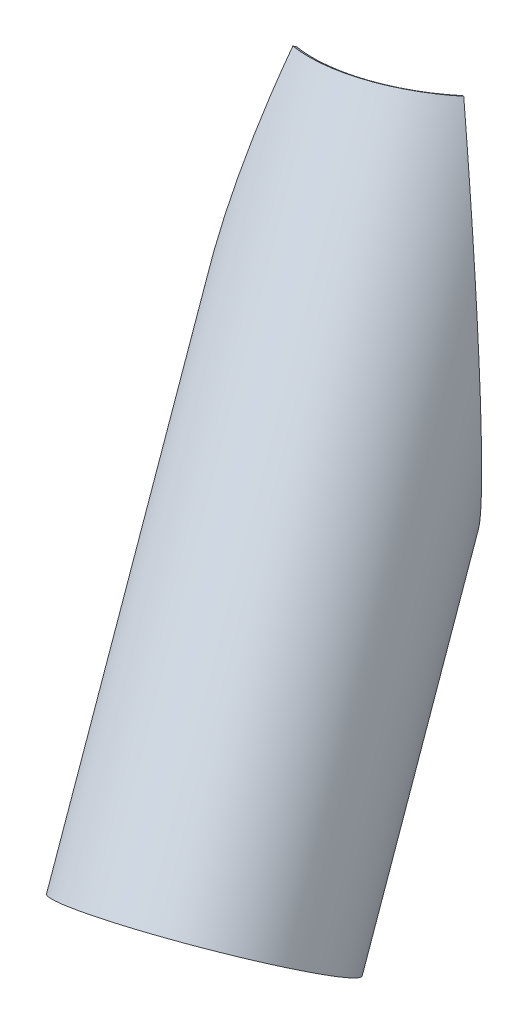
ISO-10303-21;
HEADER;
FILE_DESCRIPTION(('STEP AP214'),'2;1');
FILE_NAME('part.step','',(''),(''),'','','');
FILE_SCHEMA(('AUTOMOTIVE_DESIGN { 1 0 10303 214 1 1 1 1 }'));
ENDSEC;
DATA;
#1=APPLICATION_CONTEXT('core data for automotive mechanical design processes');
#2=APPLICATION_PROTOCOL_DEFINITION('international standard','automotive_design',2000,#1);
#3=PRODUCT_CONTEXT('',#1,'mechanical');
#4=PRODUCT('Part','Part','',(#3));
#5=PRODUCT_RELATED_PRODUCT_CATEGORY('part','',(#4));
#6=PRODUCT_DEFINITION_FORMATION('','',#4);
#7=PRODUCT_DEFINITION_CONTEXT('part definition',#1,'design');
#8=PRODUCT_DEFINITION('design','',#6,#7);
#9=PRODUCT_DEFINITION_SHAPE('','',#8);
#10=(LENGTH_UNIT() NAMED_UNIT(*) SI_UNIT(.MILLI.,.METRE.));
#11=(NAMED_UNIT(*) PLANE_ANGLE_UNIT() SI_UNIT($,.RADIAN.));
#12=(NAMED_UNIT(*) SI_UNIT($,.STERADIAN.) SOLID_ANGLE_UNIT());
#13=UNCERTAINTY_MEASURE_WITH_UNIT(LENGTH_MEASURE(1.E-05),#10,'distance_accuracy_value','');
#14=(GEOMETRIC_REPRESENTATION_CONTEXT(3) GLOBAL_UNCERTAINTY_ASSIGNED_CONTEXT((#13)) GLOBAL_UNIT_ASSIGNED_CONTEXT((#10,
#11,#12)) REPRESENTATION_CONTEXT('',''));
#15=CARTESIAN_POINT('',(0.,0.,0.));
#16=DIRECTION('',(0.,0.,1.));
#17=DIRECTION('',(1.,0.,0.));
#18=AXIS2_PLACEMENT_3D('',#15,#16,#17);
#19=CARTESIAN_POINT('',(0.688190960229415,-380.940704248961,0.500000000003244));
#20=CARTESIAN_POINT('',(2.90149185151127,-384.269135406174,2.10713807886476));
#21=CARTESIAN_POINT('',(5.04981962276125,-387.46842072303,3.66846374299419));
#22=CARTESIAN_POINT('',(8.1731321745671,-392.076278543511,5.93810687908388));
#23=CARTESIAN_POINT('',(9.1931522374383,-393.57364464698,6.67921363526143));
#24=CARTESIAN_POINT('',(11.2295632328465,-396.54903171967,8.15875343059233));
#25=CARTESIAN_POINT('',(12.2449734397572,-398.025554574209,8.89649133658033));
#26=CARTESIAN_POINT('',(17.3077852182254,-405.352485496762,12.5748367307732));
#27=CARTESIAN_POINT('',(21.3122087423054,-411.03555856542,15.484206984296));
#28=CARTESIAN_POINT('',(29.2360912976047,-422.067054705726,21.2412374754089));
#29=CARTESIAN_POINT('',(33.1518164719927,-427.410383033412,24.0862439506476));
#30=CARTESIAN_POINT('',(40.8997912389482,-437.775376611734,29.7153695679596));
#31=CARTESIAN_POINT('',(44.7355669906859,-442.801633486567,32.5020565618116));
#32=CARTESIAN_POINT('',(56.1207125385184,-457.416305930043,40.7736163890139));
#33=CARTESIAN_POINT('',(63.5477160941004,-466.540620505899,46.1700524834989));
#34=CARTESIAN_POINT('',(74.4167571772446,-479.317536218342,54.0669625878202));
#35=CARTESIAN_POINT('',(77.9964792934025,-483.427444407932,56.6677563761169));
#36=CARTESIAN_POINT('',(85.0833578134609,-491.372015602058,61.816483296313));
#37=CARTESIAN_POINT('',(88.5884522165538,-495.204285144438,64.3629695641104));
#38=CARTESIAN_POINT('',(98.9831582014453,-506.284527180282,71.9150789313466));
#39=CARTESIAN_POINT('',(105.752072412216,-513.115929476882,76.833397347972));
#40=CARTESIAN_POINT('',(118.941464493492,-525.686620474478,86.4161510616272));
#41=CARTESIAN_POINT('',(125.379060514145,-531.44221017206,91.0928246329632));
#42=CARTESIAN_POINT('',(137.932113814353,-541.924476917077,100.21299321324));
#43=CARTESIAN_POINT('',(144.044920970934,-546.648634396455,104.654561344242));
#44=CARTESIAN_POINT('',(155.921380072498,-555.078161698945,113.283684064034));
#45=CARTESIAN_POINT('',(161.685880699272,-558.78424344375,117.47144122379));
#46=CARTESIAN_POINT('',(172.885864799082,-565.221176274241,125.608619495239));
#47=CARTESIAN_POINT('',(178.313360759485,-567.947280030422,129.552328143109));
#48=CARTESIAN_POINT('',(188.825768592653,-572.434715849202,137.190035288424));
#49=CARTESIAN_POINT('',(193.912127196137,-574.196443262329,140.885263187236));
#50=CARTESIAN_POINT('',(208.633737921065,-578.053259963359,151.581236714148));
#51=CARTESIAN_POINT('',(217.738734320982,-578.720549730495,158.196215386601));
#52=CARTESIAN_POINT('',(234.440405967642,-576.3387575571,170.331015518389));
#53=CARTESIAN_POINT('',(242.031050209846,-573.291470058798,175.845859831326));
#54=CARTESIAN_POINT('',(255.627787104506,-563.551885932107,185.724399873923));
#55=CARTESIAN_POINT('',(261.630045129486,-556.861797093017,190.08541754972));
#56=CARTESIAN_POINT('',(271.953350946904,-539.87195495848,197.585639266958));
#57=CARTESIAN_POINT('',(276.275980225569,-529.567451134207,200.725929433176));
#58=CARTESIAN_POINT('',(281.410930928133,-511.4096827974,204.45687416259));
#59=CARTESIAN_POINT('',(282.896462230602,-504.912518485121,205.536384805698));
#60=CARTESIAN_POINT('',(285.403230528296,-491.008008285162,207.357538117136));
#61=CARTESIAN_POINT('',(286.423891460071,-483.602470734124,208.099084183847));
#62=CARTESIAN_POINT('',(287.980170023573,-467.89787936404,209.229798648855));
#63=CARTESIAN_POINT('',(288.516825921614,-459.587937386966,209.61951448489));
#64=CARTESIAN_POINT('',(289.085911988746,-442.058570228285,210.03318147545));
#65=CARTESIAN_POINT('',(289.118549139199,-432.840343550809,210.056964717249));
#66=CARTESIAN_POINT('',(288.655608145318,-413.458037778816,209.720533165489));
#67=CARTESIAN_POINT('',(288.160474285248,-403.305486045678,209.360906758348));
#68=CARTESIAN_POINT('',(286.611710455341,-382.025420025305,208.235503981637));
#69=CARTESIAN_POINT('',(285.559257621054,-370.911122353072,207.471068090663));
#70=CARTESIAN_POINT('',(282.857909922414,-347.665155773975,205.507996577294));
#71=CARTESIAN_POINT('',(281.209486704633,-335.541441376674,204.31039400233));
#72=CARTESIAN_POINT('',(278.265855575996,-316.621066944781,202.171980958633));
#73=CARTESIAN_POINT('',(277.206976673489,-310.196167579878,201.402669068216));
#74=CARTESIAN_POINT('',(274.921199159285,-297.06476692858,199.741736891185));
#75=CARTESIAN_POINT('',(273.6948051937,-290.361973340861,198.850579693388));
#76=CARTESIAN_POINT('',(271.069579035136,-276.685624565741,196.943217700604));
#77=CARTESIAN_POINT('',(269.670745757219,-269.712069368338,195.927013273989));
#78=CARTESIAN_POINT('',(266.695340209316,-255.497851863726,193.76548627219));
#79=CARTESIAN_POINT('',(265.120724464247,-248.265495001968,192.621505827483));
#80=CARTESIAN_POINT('',(260.101772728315,-226.083819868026,188.97468318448));
#81=CARTESIAN_POINT('',(256.364647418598,-210.66423753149,186.259583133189));
#82=CARTESIAN_POINT('',(251.166793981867,-190.625042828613,182.483357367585));
#83=CARTESIAN_POINT('',(250.101837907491,-186.58238432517,181.709631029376));
#84=CARTESIAN_POINT('',(247.91128158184,-178.395013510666,180.117998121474));
#85=CARTESIAN_POINT('',(246.786149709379,-174.252231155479,179.300457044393));
#86=CARTESIAN_POINT('',(243.319033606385,-161.677915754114,176.78126520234));
#87=CARTESIAN_POINT('',(240.885319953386,-153.100393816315,175.013081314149));
#88=CARTESIAN_POINT('',(237.042788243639,-139.947800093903,172.221518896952));
#89=CARTESIAN_POINT('',(235.729952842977,-135.515888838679,171.267774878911));
#90=CARTESIAN_POINT('',(233.038911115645,-126.557644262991,169.312698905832));
#91=CARTESIAN_POINT('',(231.660687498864,-122.030962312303,168.311316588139));
#92=CARTESIAN_POINT('',(227.398625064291,-108.224281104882,165.214476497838));
#93=CARTESIAN_POINT('',(224.39600287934,-98.746621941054,163.032773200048));
#94=CARTESIAN_POINT('',(219.635701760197,-84.1296738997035,159.574395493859));
#95=CARTESIAN_POINT('',(218.006208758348,-79.1906252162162,158.390615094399));
#96=CARTESIAN_POINT('',(214.659391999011,-69.180748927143,155.959178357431));
#97=CARTESIAN_POINT('',(212.946742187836,-64.123198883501,154.714881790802));
#98=CARTESIAN_POINT('',(207.608421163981,-48.5678563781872,150.836006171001));
#99=CARTESIAN_POINT('',(203.797950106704,-37.7354749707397,148.067273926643));
#100=CARTESIAN_POINT('',(197.675072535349,-20.8129372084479,143.619094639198));
#101=CARTESIAN_POINT('',(195.566249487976,-15.0597928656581,142.087142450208));
#102=CARTESIAN_POINT('',(192.842302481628,-7.73022069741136,140.108136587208));
#103=CARTESIAN_POINT('',(192.29408751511,-6.25997157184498,139.709837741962));
#104=CARTESIAN_POINT('',(191.177291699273,-3.27504674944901,138.898374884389));
#105=CARTESIAN_POINT('',(190.609948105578,-1.76372557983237,138.486118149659));
#106=CARTESIAN_POINT('',(188.880712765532,2.82659609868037,137.229545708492));
#107=CARTESIAN_POINT('',(187.69161805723,5.96195736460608,136.365431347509));
#108=CARTESIAN_POINT('',(181.559786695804,22.0114367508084,131.909635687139));
#109=CARTESIAN_POINT('',(176.058356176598,36.0443357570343,127.913612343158));
#110=CARTESIAN_POINT('',(169.893568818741,51.2248383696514,123.434902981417));
#111=CARTESIAN_POINT('',(2.21968503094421,-377.624088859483,5.2596836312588));
#112=CARTESIAN_POINT('',(4.38925418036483,-380.952580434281,6.88093510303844));
#113=CARTESIAN_POINT('',(6.49500971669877,-384.152216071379,8.45553815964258));
#114=CARTESIAN_POINT('',(9.5562521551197,-388.760958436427,10.7439469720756));
#115=CARTESIAN_POINT('',(10.5559704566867,-390.258677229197,11.4910911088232));
#116=CARTESIAN_POINT('',(12.5517930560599,-393.234890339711,12.9825094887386));
#117=CARTESIAN_POINT('',(13.5469359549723,-394.711886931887,13.7260817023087));
#118=CARTESIAN_POINT('',(18.5085531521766,-402.04148527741,17.4330789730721));
#119=CARTESIAN_POINT('',(22.4324808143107,-407.727647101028,20.3637078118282));
#120=CARTESIAN_POINT('',(30.1962090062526,-418.767124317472,26.1601244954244));
#121=CARTESIAN_POINT('',(34.0323517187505,-424.115341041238,29.0232400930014));
#122=CARTESIAN_POINT('',(41.6220125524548,-434.491817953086,34.6856023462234));
#123=CARTESIAN_POINT('',(45.3789842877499,-439.524676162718,37.4874302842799));
#124=CARTESIAN_POINT('',(56.528992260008,-454.161599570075,45.8001200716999));
#125=CARTESIAN_POINT('',(63.8009420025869,-463.304010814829,51.2182504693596));
#126=CARTESIAN_POINT('',(74.4407256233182,-476.112432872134,59.1397089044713));
#127=CARTESIAN_POINT('',(77.9445423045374,-480.233574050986,61.7473600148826));
#128=CARTESIAN_POINT('',(84.8803677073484,-488.202057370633,66.9072630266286));
#129=CARTESIAN_POINT('',(88.3103581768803,-492.047000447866,69.4580627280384));
#130=CARTESIAN_POINT('',(98.4811785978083,-503.167316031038,77.0193947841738));
#131=CARTESIAN_POINT('',(105.102740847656,-510.028171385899,81.9389035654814));
#132=CARTESIAN_POINT('',(118.002000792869,-522.662707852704,91.5147229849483));
#133=CARTESIAN_POINT('',(124.296439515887,-528.452770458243,96.1832668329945));
#134=CARTESIAN_POINT('',(136.567330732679,-539.008736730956,105.278291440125));
#135=CARTESIAN_POINT('',(142.541191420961,-543.772107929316,109.702846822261));
#136=CARTESIAN_POINT('',(154.144647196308,-552.284357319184,118.289547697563));
#137=CARTESIAN_POINT('',(159.775070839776,-556.033947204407,122.451902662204));
#138=CARTESIAN_POINT('',(170.711449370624,-562.562088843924,130.53015293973));
#139=CARTESIAN_POINT('',(176.00960433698,-565.335830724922,134.440373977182));
#140=CARTESIAN_POINT('',(186.268268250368,-569.922446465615,142.003313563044));
#141=CARTESIAN_POINT('',(191.230188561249,-571.735733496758,145.657244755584));
#142=CARTESIAN_POINT('',(205.586583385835,-575.752634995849,156.218127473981));
#143=CARTESIAN_POINT('',(214.458713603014,-576.533929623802,162.72805541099));
#144=CARTESIAN_POINT('',(230.718565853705,-574.392749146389,174.62500839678));
#145=CARTESIAN_POINT('',(238.100418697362,-571.471965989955,180.0071661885));
#146=CARTESIAN_POINT('',(251.30574680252,-561.996358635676,189.594442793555));
#147=CARTESIAN_POINT('',(257.125495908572,-555.44367383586,193.796956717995));
#148=CARTESIAN_POINT('',(267.112601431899,-538.738021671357,200.95593594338));
#149=CARTESIAN_POINT('',(271.281478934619,-528.580365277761,203.913409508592));
#150=CARTESIAN_POINT('',(276.209721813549,-510.648701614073,207.353110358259));
#151=CARTESIAN_POINT('',(277.630393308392,-504.227812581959,208.332788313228));
#152=CARTESIAN_POINT('',(280.015751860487,-490.477681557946,209.948677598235));
#153=CARTESIAN_POINT('',(280.979885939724,-483.150228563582,210.584815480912));
#154=CARTESIAN_POINT('',(282.432026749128,-467.603223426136,211.499570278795));
#155=CARTESIAN_POINT('',(282.921000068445,-459.372889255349,211.778589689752));
#156=CARTESIAN_POINT('',(283.404069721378,-442.004048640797,211.965748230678));
#157=CARTESIAN_POINT('',(283.398371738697,-432.86672897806,211.873738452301));
#158=CARTESIAN_POINT('',(282.868579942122,-413.647539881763,211.30046544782));
#159=CARTESIAN_POINT('',(282.344966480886,-403.577106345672,210.819923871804));
#160=CARTESIAN_POINT('',(280.749727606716,-382.462433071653,209.447451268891));
#161=CARTESIAN_POINT('',(279.679303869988,-371.431316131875,208.557001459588));
#162=CARTESIAN_POINT('',(276.95330661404,-348.352732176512,206.336614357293));
#163=CARTESIAN_POINT('',(275.298226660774,-336.313165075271,205.007789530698));
#164=CARTESIAN_POINT('',(272.353808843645,-317.519230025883,202.669208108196));
#165=CARTESIAN_POINT('',(271.296196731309,-311.136485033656,201.83266407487));
#166=CARTESIAN_POINT('',(269.016154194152,-298.089637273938,200.035840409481));
#167=CARTESIAN_POINT('',(267.794230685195,-291.429217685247,199.07606199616));
#168=CARTESIAN_POINT('',(265.181306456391,-277.837714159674,197.030211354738));
#169=CARTESIAN_POINT('',(263.790304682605,-270.906630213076,195.944139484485));
#170=CARTESIAN_POINT('',(260.834074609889,-256.77734804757,193.641747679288));
#171=CARTESIAN_POINT('',(259.270785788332,-249.587407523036,192.426851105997));
#172=CARTESIAN_POINT('',(254.291478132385,-227.533322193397,188.564899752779));
#173=CARTESIAN_POINT('',(250.58833412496,-212.199171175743,185.703337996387));
#174=CARTESIAN_POINT('',(245.443468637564,-192.266514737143,181.74101745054));
#175=CARTESIAN_POINT('',(244.389625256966,-188.245133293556,180.929953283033));
#176=CARTESIAN_POINT('',(242.222448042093,-180.100407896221,179.263125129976));
#177=CARTESIAN_POINT('',(241.109578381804,-175.978983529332,178.407744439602));
#178=CARTESIAN_POINT('',(237.681028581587,-163.468810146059,175.774347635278));
#179=CARTESIAN_POINT('',(235.275398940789,-154.934140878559,173.929111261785));
#180=CARTESIAN_POINT('',(231.478796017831,-141.84580152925,171.020773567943));
#181=CARTESIAN_POINT('',(230.1819039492,-137.435304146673,170.027905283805));
#182=CARTESIAN_POINT('',(227.524056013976,-128.519850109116,167.994215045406));
#183=CARTESIAN_POINT('',(226.163081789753,-124.014547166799,166.953339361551));
#184=CARTESIAN_POINT('',(221.955141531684,-110.272303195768,163.736771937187));
#185=CARTESIAN_POINT('',(218.991661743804,-100.837865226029,161.473838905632));
#186=CARTESIAN_POINT('',(214.295079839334,-86.2858764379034,157.891788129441));
#187=CARTESIAN_POINT('',(212.687660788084,-81.3685017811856,156.666479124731));
#188=CARTESIAN_POINT('',(209.386728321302,-71.4019672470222,154.151430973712));
#189=CARTESIAN_POINT('',(207.697821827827,-66.3660300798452,152.86516032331));
#190=CARTESIAN_POINT('',(202.434357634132,-50.8762249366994,148.858076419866));
#191=CARTESIAN_POINT('',(198.678421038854,-40.0882582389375,146.001221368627));
#192=CARTESIAN_POINT('',(192.645141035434,-23.2328768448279,141.417477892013));
#193=CARTESIAN_POINT('',(190.567483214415,-17.5022061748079,139.839775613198));
#194=CARTESIAN_POINT('',(187.884205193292,-10.2007726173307,137.802951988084));
#195=CARTESIAN_POINT('',(187.344195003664,-8.73614386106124,137.393078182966));
#196=CARTESIAN_POINT('',(186.244154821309,-5.76257873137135,136.558164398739));
#197=CARTESIAN_POINT('',(185.685343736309,-4.25698398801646,136.134058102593));
#198=CARTESIAN_POINT('',(183.982180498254,0.316024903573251,134.841571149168));
#199=CARTESIAN_POINT('',(182.811099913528,3.43966622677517,133.953025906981));
#200=CARTESIAN_POINT('',(176.772645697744,19.4297429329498,129.372728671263));
#201=CARTESIAN_POINT('',(171.35648509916,33.4125316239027,125.269555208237));
#202=CARTESIAN_POINT('',(165.289466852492,48.5416325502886,120.677612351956));
#203=B_SPLINE_SURFACE_WITH_KNOTS('',1,3,((#19,#20,#21,#22,#23,#24,#25,#26,#27,#28,#29,#30,#31,
#32,#33,#34,#35,#36,#37,#38,#39,#40,#41,#42,#43,#44,#45,#46,#47,#48,#49,#50,#51,#52,#53,#54,#55,
#56,#57,#58,#59,#60,#61,#62,#63,#64,#65,#66,#67,#68,#69,#70,#71,#72,#73,#74,#75,#76,#77,#78,#79,
#80,#81,#82,#83,#84,#85,#86,#87,#88,#89,#90,#91,#92,#93,#94,#95,#96,#97,#98,#99,#100,#101,#102,
#103,#104,#105,#106,#107,#108,#109,#110),(#111,#112,#113,#114,#115,#116,#117,#118,#119,#120,
#121,#122,#123,#124,#125,#126,#127,#128,#129,#130,#131,#132,#133,#134,#135,#136,#137,#138,#139,
#140,#141,#142,#143,#144,#145,#146,#147,#148,#149,#150,#151,#152,#153,#154,#155,#156,#157,#158,
#159,#160,#161,#162,#163,#164,#165,#166,#167,#168,#169,#170,#171,#172,#173,#174,#175,#176,#177,
#178,#179,#180,#181,#182,#183,#184,#185,#186,#187,#188,#189,#190,#191,#192,#193,#194,#195,#196,
#197,#198,#199,#200,#201,#202)),.UNSPECIFIED.,.F.,.F.,.F.,(2,2),(4,2,2,2,2,2,2,2,2,2,2,2,2,2,2,
2,2,2,2,2,2,2,2,2,2,2,2,2,2,2,2,2,2,2,2,2,2,2,2,2,2,2,2,2,2,4),(0.,1.),(0.,0.0078125,0.01171875,
0.015625,0.03125,0.046875,0.0625,0.09375,0.109375,0.125,0.15625,0.1875,0.21875,0.25,0.28125,
0.3125,0.375,0.4375,0.5,0.5625,0.59375,0.625,0.65625,0.6875,0.71875,0.75,0.78125,0.796875,
0.8125,0.828125,0.84375,0.875,0.8828125,0.890625,0.90625,0.9140625,0.921875,0.9375,0.9453125,
0.953125,0.96875,0.9765625,0.978515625,0.98046875,0.984375,1.),.UNSPECIFIED.);
#204=CARTESIAN_POINT('',(0.688190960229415,-380.940704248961,0.500000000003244));
#205=CARTESIAN_POINT('',(2.21968503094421,-377.624088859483,5.2596836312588));
#206=B_SPLINE_CURVE_WITH_KNOTS('',1,(#204,#205),.UNSPECIFIED.,.F.,.F.,(2,2),(0.,1.),.UNSPECIFIED.);
#207=CARTESIAN_POINT('',(2.2196850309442,-377.624088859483,5.25968363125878));
#208=VERTEX_POINT('',#207);
#209=CARTESIAN_POINT('',(0.688190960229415,-380.940704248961,0.500000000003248));
#210=VERTEX_POINT('',#209);
#211=EDGE_CURVE('E13',#208,#210,#206,.F.);
#212=CARTESIAN_POINT('',(2.21968503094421,-377.624088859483,5.2596836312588));
#213=CARTESIAN_POINT('',(4.38925418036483,-380.952580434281,6.88093510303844));
#214=CARTESIAN_POINT('',(6.49500971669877,-384.152216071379,8.45553815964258));
#215=CARTESIAN_POINT('',(9.5562521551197,-388.760958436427,10.7439469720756));
#216=CARTESIAN_POINT('',(10.5559704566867,-390.258677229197,11.4910911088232));
#217=CARTESIAN_POINT('',(12.5517930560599,-393.234890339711,12.9825094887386));
#218=CARTESIAN_POINT('',(13.5469359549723,-394.711886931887,13.7260817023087));
#219=CARTESIAN_POINT('',(18.5085531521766,-402.04148527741,17.4330789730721));
#220=CARTESIAN_POINT('',(22.4324808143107,-407.727647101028,20.3637078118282));
#221=CARTESIAN_POINT('',(30.1962090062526,-418.767124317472,26.1601244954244));
#222=CARTESIAN_POINT('',(34.0323517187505,-424.115341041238,29.0232400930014));
#223=CARTESIAN_POINT('',(41.6220125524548,-434.491817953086,34.6856023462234));
#224=CARTESIAN_POINT('',(45.3789842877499,-439.524676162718,37.4874302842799));
#225=CARTESIAN_POINT('',(56.528992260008,-454.161599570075,45.8001200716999));
#226=CARTESIAN_POINT('',(63.8009420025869,-463.304010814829,51.2182504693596));
#227=CARTESIAN_POINT('',(74.4407256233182,-476.112432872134,59.1397089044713));
#228=CARTESIAN_POINT('',(77.9445423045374,-480.233574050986,61.7473600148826));
#229=CARTESIAN_POINT('',(84.8803677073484,-488.202057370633,66.9072630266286));
#230=CARTESIAN_POINT('',(88.3103581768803,-492.047000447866,69.4580627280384));
#231=CARTESIAN_POINT('',(98.4811785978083,-503.167316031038,77.0193947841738));
#232=CARTESIAN_POINT('',(105.102740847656,-510.028171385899,81.9389035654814));
#233=CARTESIAN_POINT('',(118.002000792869,-522.662707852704,91.5147229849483));
#234=CARTESIAN_POINT('',(124.296439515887,-528.452770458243,96.1832668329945));
#235=CARTESIAN_POINT('',(136.567330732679,-539.008736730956,105.278291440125));
#236=CARTESIAN_POINT('',(142.541191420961,-543.772107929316,109.702846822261));
#237=CARTESIAN_POINT('',(154.144647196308,-552.284357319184,118.289547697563));
#238=CARTESIAN_POINT('',(159.775070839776,-556.033947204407,122.451902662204));
#239=CARTESIAN_POINT('',(170.711449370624,-562.562088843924,130.53015293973));
#240=CARTESIAN_POINT('',(176.00960433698,-565.335830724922,134.440373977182));
#241=CARTESIAN_POINT('',(186.268268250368,-569.922446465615,142.003313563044));
#242=CARTESIAN_POINT('',(191.230188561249,-571.735733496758,145.657244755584));
#243=CARTESIAN_POINT('',(205.586583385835,-575.752634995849,156.218127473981));
#244=CARTESIAN_POINT('',(214.458713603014,-576.533929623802,162.72805541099));
#245=CARTESIAN_POINT('',(230.718565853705,-574.392749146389,174.62500839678));
#246=CARTESIAN_POINT('',(238.100418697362,-571.471965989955,180.0071661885));
#247=CARTESIAN_POINT('',(251.30574680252,-561.996358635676,189.594442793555));
#248=CARTESIAN_POINT('',(257.125495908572,-555.44367383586,193.796956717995));
#249=CARTESIAN_POINT('',(267.112601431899,-538.738021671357,200.95593594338));
#250=CARTESIAN_POINT('',(271.281478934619,-528.580365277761,203.913409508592));
#251=CARTESIAN_POINT('',(276.209721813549,-510.648701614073,207.353110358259));
#252=CARTESIAN_POINT('',(277.630393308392,-504.227812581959,208.332788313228));
#253=CARTESIAN_POINT('',(280.015751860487,-490.477681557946,209.948677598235));
#254=CARTESIAN_POINT('',(280.979885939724,-483.150228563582,210.584815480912));
#255=CARTESIAN_POINT('',(282.432026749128,-467.603223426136,211.499570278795));
#256=CARTESIAN_POINT('',(282.921000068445,-459.372889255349,211.778589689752));
#257=CARTESIAN_POINT('',(283.404069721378,-442.004048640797,211.965748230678));
#258=CARTESIAN_POINT('',(283.398371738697,-432.86672897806,211.873738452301));
#259=CARTESIAN_POINT('',(282.868579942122,-413.647539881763,211.30046544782));
#260=CARTESIAN_POINT('',(282.344966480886,-403.577106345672,210.819923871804));
#261=CARTESIAN_POINT('',(280.749727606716,-382.462433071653,209.447451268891));
#262=CARTESIAN_POINT('',(279.679303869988,-371.431316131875,208.557001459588));
#263=CARTESIAN_POINT('',(276.95330661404,-348.352732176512,206.336614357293));
#264=CARTESIAN_POINT('',(275.298226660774,-336.313165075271,205.007789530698));
#265=CARTESIAN_POINT('',(272.353808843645,-317.519230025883,202.669208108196));
#266=CARTESIAN_POINT('',(271.296196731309,-311.136485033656,201.83266407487));
#267=CARTESIAN_POINT('',(269.016154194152,-298.089637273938,200.035840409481));
#268=CARTESIAN_POINT('',(267.794230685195,-291.429217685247,199.07606199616));
#269=CARTESIAN_POINT('',(265.181306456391,-277.837714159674,197.030211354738));
#270=CARTESIAN_POINT('',(263.790304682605,-270.906630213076,195.944139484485));
#271=CARTESIAN_POINT('',(260.834074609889,-256.77734804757,193.641747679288));
#272=CARTESIAN_POINT('',(259.270785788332,-249.587407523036,192.426851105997));
#273=CARTESIAN_POINT('',(254.291478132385,-227.533322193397,188.564899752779));
#274=CARTESIAN_POINT('',(250.58833412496,-212.199171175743,185.703337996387));
#275=CARTESIAN_POINT('',(245.443468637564,-192.266514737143,181.74101745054));
#276=CARTESIAN_POINT('',(244.389625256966,-188.245133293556,180.929953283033));
#277=CARTESIAN_POINT('',(242.222448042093,-180.100407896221,179.263125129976));
#278=CARTESIAN_POINT('',(241.109578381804,-175.978983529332,178.407744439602));
#279=CARTESIAN_POINT('',(237.681028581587,-163.468810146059,175.774347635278));
#280=CARTESIAN_POINT('',(235.275398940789,-154.934140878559,173.929111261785));
#281=CARTESIAN_POINT('',(231.478796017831,-141.84580152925,171.020773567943));
#282=CARTESIAN_POINT('',(230.1819039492,-137.435304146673,170.027905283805));
#283=CARTESIAN_POINT('',(227.524056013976,-128.519850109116,167.994215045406));
#284=CARTESIAN_POINT('',(226.163081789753,-124.014547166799,166.953339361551));
#285=CARTESIAN_POINT('',(221.955141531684,-110.272303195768,163.736771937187));
#286=CARTESIAN_POINT('',(218.991661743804,-100.837865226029,161.473838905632));
#287=CARTESIAN_POINT('',(214.295079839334,-86.2858764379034,157.891788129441));
#288=CARTESIAN_POINT('',(212.687660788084,-81.3685017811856,156.666479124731));
#289=CARTESIAN_POINT('',(209.386728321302,-71.4019672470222,154.151430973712));
#290=CARTESIAN_POINT('',(207.697821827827,-66.3660300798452,152.86516032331));
#291=CARTESIAN_POINT('',(202.434357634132,-50.8762249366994,148.858076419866));
#292=CARTESIAN_POINT('',(198.678421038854,-40.0882582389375,146.001221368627));
#293=CARTESIAN_POINT('',(192.645141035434,-23.2328768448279,141.417477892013));
#294=CARTESIAN_POINT('',(190.567483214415,-17.5022061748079,139.839775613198));
#295=CARTESIAN_POINT('',(187.884205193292,-10.2007726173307,137.802951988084));
#296=CARTESIAN_POINT('',(187.344195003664,-8.73614386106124,137.393078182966));
#297=CARTESIAN_POINT('',(186.244154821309,-5.76257873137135,136.558164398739));
#298=CARTESIAN_POINT('',(185.685343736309,-4.25698398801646,136.134058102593));
#299=CARTESIAN_POINT('',(183.982180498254,0.316024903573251,134.841571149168));
#300=CARTESIAN_POINT('',(182.811099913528,3.43966622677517,133.953025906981));
#301=CARTESIAN_POINT('',(176.772645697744,19.4297429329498,129.372728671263));
#302=CARTESIAN_POINT('',(171.35648509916,33.4125316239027,125.269555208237));
#303=CARTESIAN_POINT('',(165.289466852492,48.5416325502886,120.677612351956));
#304=B_SPLINE_CURVE_WITH_KNOTS('',3,(#212,#213,#214,#215,#216,#217,#218,#219,#220,#221,#222,
#223,#224,#225,#226,#227,#228,#229,#230,#231,#232,#233,#234,#235,#236,#237,#238,#239,#240,#241,
#242,#243,#244,#245,#246,#247,#248,#249,#250,#251,#252,#253,#254,#255,#256,#257,#258,#259,#260,
#261,#262,#263,#264,#265,#266,#267,#268,#269,#270,#271,#272,#273,#274,#275,#276,#277,#278,#279,
#280,#281,#282,#283,#284,#285,#286,#287,#288,#289,#290,#291,#292,#293,#294,#295,#296,#297,#298,
#299,#300,#301,#302,#303),.UNSPECIFIED.,.F.,.F.,(4,2,2,2,2,2,2,2,2,2,2,2,2,2,2,2,2,2,2,2,2,2,2,
2,2,2,2,2,2,2,2,2,2,2,2,2,2,2,2,2,2,2,2,2,2,4),(0.,0.0078125,0.01171875,0.015625,0.03125,
0.046875,0.0625,0.09375,0.109375,0.125,0.15625,0.1875,0.21875,0.25,0.28125,0.3125,0.375,0.4375,
0.5,0.5625,0.59375,0.625,0.65625,0.6875,0.71875,0.75,0.78125,0.796875,0.8125,0.828125,0.84375,
0.875,0.8828125,0.890625,0.90625,0.9140625,0.921875,0.9375,0.9453125,0.953125,0.96875,0.9765625,
0.978515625,0.98046875,0.984375,1.),.UNSPECIFIED.);
#305=CARTESIAN_POINT('',(165.289466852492,48.5416325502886,120.677612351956));
#306=VERTEX_POINT('',#305);
#307=EDGE_CURVE('E104',#208,#306,#304,.T.);
#308=CARTESIAN_POINT('',(165.289466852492,48.5416325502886,120.677612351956));
#309=CARTESIAN_POINT('',(169.893568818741,51.2248383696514,123.434902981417));
#310=B_SPLINE_CURVE_WITH_KNOTS('',1,(#308,#309),.UNSPECIFIED.,.F.,.F.,(2,2),(0.,1.),.UNSPECIFIED.);
#311=CARTESIAN_POINT('',(169.893568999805,51.2248379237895,123.43490311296));
#312=VERTEX_POINT('',#311);
#313=EDGE_CURVE('E51',#306,#312,#310,.T.);
#314=CARTESIAN_POINT('',(169.893568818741,51.2248383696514,123.434902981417));
#315=CARTESIAN_POINT('',(176.058356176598,36.0443357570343,127.913612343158));
#316=CARTESIAN_POINT('',(181.559786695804,22.0114367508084,131.909635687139));
#317=CARTESIAN_POINT('',(187.69161805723,5.96195736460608,136.365431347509));
#318=CARTESIAN_POINT('',(188.880712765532,2.82659609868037,137.229545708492));
#319=CARTESIAN_POINT('',(190.609948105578,-1.76372557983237,138.486118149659));
#320=CARTESIAN_POINT('',(191.177291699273,-3.27504674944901,138.898374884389));
#321=CARTESIAN_POINT('',(192.29408751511,-6.25997157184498,139.709837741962));
#322=CARTESIAN_POINT('',(192.842302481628,-7.73022069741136,140.108136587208));
#323=CARTESIAN_POINT('',(195.566249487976,-15.0597928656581,142.087142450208));
#324=CARTESIAN_POINT('',(197.675072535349,-20.8129372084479,143.619094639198));
#325=CARTESIAN_POINT('',(203.797950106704,-37.7354749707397,148.067273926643));
#326=CARTESIAN_POINT('',(207.608421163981,-48.5678563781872,150.836006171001));
#327=CARTESIAN_POINT('',(212.946742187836,-64.123198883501,154.714881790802));
#328=CARTESIAN_POINT('',(214.659391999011,-69.180748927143,155.959178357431));
#329=CARTESIAN_POINT('',(218.006208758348,-79.1906252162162,158.390615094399));
#330=CARTESIAN_POINT('',(219.635701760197,-84.1296738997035,159.574395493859));
#331=CARTESIAN_POINT('',(224.39600287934,-98.746621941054,163.032773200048));
#332=CARTESIAN_POINT('',(227.398625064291,-108.224281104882,165.214476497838));
#333=CARTESIAN_POINT('',(231.660687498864,-122.030962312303,168.311316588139));
#334=CARTESIAN_POINT('',(233.038911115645,-126.557644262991,169.312698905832));
#335=CARTESIAN_POINT('',(235.729952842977,-135.515888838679,171.267774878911));
#336=CARTESIAN_POINT('',(237.042788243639,-139.947800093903,172.221518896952));
#337=CARTESIAN_POINT('',(240.885319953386,-153.100393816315,175.013081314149));
#338=CARTESIAN_POINT('',(243.319033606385,-161.677915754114,176.78126520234));
#339=CARTESIAN_POINT('',(246.786149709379,-174.252231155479,179.300457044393));
#340=CARTESIAN_POINT('',(247.91128158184,-178.395013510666,180.117998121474));
#341=CARTESIAN_POINT('',(250.101837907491,-186.58238432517,181.709631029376));
#342=CARTESIAN_POINT('',(251.166793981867,-190.625042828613,182.483357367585));
#343=CARTESIAN_POINT('',(256.364647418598,-210.66423753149,186.259583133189));
#344=CARTESIAN_POINT('',(260.101772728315,-226.083819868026,188.97468318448));
#345=CARTESIAN_POINT('',(265.120724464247,-248.265495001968,192.621505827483));
#346=CARTESIAN_POINT('',(266.695340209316,-255.497851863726,193.76548627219));
#347=CARTESIAN_POINT('',(269.670745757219,-269.712069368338,195.927013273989));
#348=CARTESIAN_POINT('',(271.069579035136,-276.685624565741,196.943217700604));
#349=CARTESIAN_POINT('',(273.6948051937,-290.361973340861,198.850579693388));
#350=CARTESIAN_POINT('',(274.921199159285,-297.06476692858,199.741736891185));
#351=CARTESIAN_POINT('',(277.206976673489,-310.196167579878,201.402669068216));
#352=CARTESIAN_POINT('',(278.265855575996,-316.621066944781,202.171980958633));
#353=CARTESIAN_POINT('',(281.209486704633,-335.541441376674,204.31039400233));
#354=CARTESIAN_POINT('',(282.857909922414,-347.665155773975,205.507996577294));
#355=CARTESIAN_POINT('',(285.559257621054,-370.911122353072,207.471068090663));
#356=CARTESIAN_POINT('',(286.611710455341,-382.025420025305,208.235503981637));
#357=CARTESIAN_POINT('',(288.160474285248,-403.305486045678,209.360906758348));
#358=CARTESIAN_POINT('',(288.655608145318,-413.458037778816,209.720533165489));
#359=CARTESIAN_POINT('',(289.118549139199,-432.840343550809,210.056964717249));
#360=CARTESIAN_POINT('',(289.085911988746,-442.058570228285,210.03318147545));
#361=CARTESIAN_POINT('',(288.516825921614,-459.587937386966,209.61951448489));
#362=CARTESIAN_POINT('',(287.980170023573,-467.89787936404,209.229798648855));
#363=CARTESIAN_POINT('',(286.423891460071,-483.602470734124,208.099084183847));
#364=CARTESIAN_POINT('',(285.403230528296,-491.008008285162,207.357538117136));
#365=CARTESIAN_POINT('',(282.896462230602,-504.912518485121,205.536384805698));
#366=CARTESIAN_POINT('',(281.410930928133,-511.4096827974,204.45687416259));
#367=CARTESIAN_POINT('',(276.275980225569,-529.567451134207,200.725929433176));
#368=CARTESIAN_POINT('',(271.953350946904,-539.87195495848,197.585639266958));
#369=CARTESIAN_POINT('',(261.630045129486,-556.861797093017,190.08541754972));
#370=CARTESIAN_POINT('',(255.627787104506,-563.551885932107,185.724399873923));
#371=CARTESIAN_POINT('',(242.031050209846,-573.291470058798,175.845859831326));
#372=CARTESIAN_POINT('',(234.440405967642,-576.3387575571,170.331015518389));
#373=CARTESIAN_POINT('',(217.738734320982,-578.720549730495,158.196215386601));
#374=CARTESIAN_POINT('',(208.633737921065,-578.053259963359,151.581236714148));
#375=CARTESIAN_POINT('',(193.912127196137,-574.196443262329,140.885263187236));
#376=CARTESIAN_POINT('',(188.825768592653,-572.434715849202,137.190035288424));
#377=CARTESIAN_POINT('',(178.313360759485,-567.947280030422,129.552328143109));
#378=CARTESIAN_POINT('',(172.885864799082,-565.221176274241,125.608619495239));
#379=CARTESIAN_POINT('',(161.685880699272,-558.78424344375,117.47144122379));
#380=CARTESIAN_POINT('',(155.921380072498,-555.078161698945,113.283684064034));
#381=CARTESIAN_POINT('',(144.044920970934,-546.648634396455,104.654561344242));
#382=CARTESIAN_POINT('',(137.932113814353,-541.924476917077,100.21299321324));
#383=CARTESIAN_POINT('',(125.379060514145,-531.44221017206,91.0928246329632));
#384=CARTESIAN_POINT('',(118.941464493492,-525.686620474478,86.4161510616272));
#385=CARTESIAN_POINT('',(105.752072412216,-513.115929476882,76.833397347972));
#386=CARTESIAN_POINT('',(98.9831582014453,-506.284527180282,71.9150789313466));
#387=CARTESIAN_POINT('',(88.5884522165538,-495.204285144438,64.3629695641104));
#388=CARTESIAN_POINT('',(85.0833578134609,-491.372015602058,61.816483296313));
#389=CARTESIAN_POINT('',(77.9964792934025,-483.427444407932,56.6677563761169));
#390=CARTESIAN_POINT('',(74.4167571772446,-479.317536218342,54.0669625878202));
#391=CARTESIAN_POINT('',(63.5477160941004,-466.540620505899,46.1700524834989));
#392=CARTESIAN_POINT('',(56.1207125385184,-457.416305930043,40.7736163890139));
#393=CARTESIAN_POINT('',(44.7355669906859,-442.801633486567,32.5020565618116));
#394=CARTESIAN_POINT('',(40.8997912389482,-437.775376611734,29.7153695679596));
#395=CARTESIAN_POINT('',(33.1518164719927,-427.410383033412,24.0862439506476));
#396=CARTESIAN_POINT('',(29.2360912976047,-422.067054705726,21.2412374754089));
#397=CARTESIAN_POINT('',(21.3122087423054,-411.03555856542,15.484206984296));
#398=CARTESIAN_POINT('',(17.3077852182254,-405.352485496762,12.5748367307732));
#399=CARTESIAN_POINT('',(12.2449734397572,-398.025554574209,8.89649133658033));
#400=CARTESIAN_POINT('',(11.2295632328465,-396.54903171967,8.15875343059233));
#401=CARTESIAN_POINT('',(9.1931522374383,-393.57364464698,6.67921363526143));
#402=CARTESIAN_POINT('',(8.1731321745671,-392.076278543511,5.93810687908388));
#403=CARTESIAN_POINT('',(5.04981962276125,-387.46842072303,3.66846374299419));
#404=CARTESIAN_POINT('',(2.90149185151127,-384.269135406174,2.10713807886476));
#405=CARTESIAN_POINT('',(0.688190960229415,-380.940704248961,0.500000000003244));
#406=B_SPLINE_CURVE_WITH_KNOTS('',3,(#314,#315,#316,#317,#318,#319,#320,#321,#322,#323,#324,
#325,#326,#327,#328,#329,#330,#331,#332,#333,#334,#335,#336,#337,#338,#339,#340,#341,#342,#343,
#344,#345,#346,#347,#348,#349,#350,#351,#352,#353,#354,#355,#356,#357,#358,#359,#360,#361,#362,
#363,#364,#365,#366,#367,#368,#369,#370,#371,#372,#373,#374,#375,#376,#377,#378,#379,#380,#381,
#382,#383,#384,#385,#386,#387,#388,#389,#390,#391,#392,#393,#394,#395,#396,#397,#398,#399,#400,
#401,#402,#403,#404,#405),.UNSPECIFIED.,.F.,.F.,(4,2,2,2,2,2,2,2,2,2,2,2,2,2,2,2,2,2,2,2,2,2,2,
2,2,2,2,2,2,2,2,2,2,2,2,2,2,2,2,2,2,2,2,2,2,4),(0.,0.015625,0.01953125,0.021484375,0.0234375,
0.03125,0.046875,0.0546875,0.0625,0.078125,0.0859375,0.09375,0.109375,0.1171875,0.125,0.15625,
0.171875,0.1875,0.203125,0.21875,0.25,0.28125,0.3125,0.34375,0.375,0.40625,0.4375,0.5,0.5625,
0.625,0.6875,0.71875,0.75,0.78125,0.8125,0.84375,0.875,0.890625,0.90625,0.9375,0.953125,0.96875,
0.984375,0.98828125,0.9921875,1.),.UNSPECIFIED.);
#407=EDGE_CURVE('E102',#210,#312,#406,.F.);
#408=ORIENTED_EDGE('',*,*,#211,.F.);
#409=ORIENTED_EDGE('',*,*,#307,.T.);
#410=ORIENTED_EDGE('',*,*,#313,.T.);
#411=ORIENTED_EDGE('',*,*,#407,.F.);
#412=EDGE_LOOP('',(#408,#409,#410,#411));
#413=FACE_BOUND('',#412,.T.);
#414=ADVANCED_FACE('F40',(#413),#203,.T.);
#415=CARTESIAN_POINT('',(-64.8935688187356,51.2248383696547,199.721868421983));
#416=CARTESIAN_POINT('',(-63.4052559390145,51.5031277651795,200.204933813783));
#417=CARTESIAN_POINT('',(-62.0814417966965,51.7438906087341,200.617299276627));
#418=CARTESIAN_POINT('',(-60.7815389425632,51.9778247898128,201.011483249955));
#419=CARTESIAN_POINT('',(-60.6397341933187,52.0033031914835,201.054310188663));
#420=CARTESIAN_POINT('',(-60.4309797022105,52.0407612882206,201.117115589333));
#421=CARTESIAN_POINT('',(-60.3470034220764,52.0558195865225,201.142333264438));
#422=CARTESIAN_POINT('',(-60.1824838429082,52.0852831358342,201.191618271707));
#423=CARTESIAN_POINT('',(-60.1002679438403,52.0999909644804,201.216192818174));
#424=CARTESIAN_POINT('',(-59.6894085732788,52.173410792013,201.338726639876));
#425=CARTESIAN_POINT('',(-59.3614254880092,52.2317648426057,201.43566918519));
#426=CARTESIAN_POINT('',(-58.7068851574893,52.3477199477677,201.627407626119));
#427=CARTESIAN_POINT('',(-58.3803279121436,52.4053210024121,201.722203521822));
#428=CARTESIAN_POINT('',(-57.7286559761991,52.5197807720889,201.909670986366));
#429=CARTESIAN_POINT('',(-57.4078272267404,52.5758930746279,202.00113201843));
#430=CARTESIAN_POINT('',(-55.7644714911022,52.8620895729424,202.465287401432));
#431=CARTESIAN_POINT('',(-54.4474433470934,53.0875018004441,202.8234106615));
#432=CARTESIAN_POINT('',(-52.4687858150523,53.4202386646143,203.340822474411));
#433=CARTESIAN_POINT('',(-51.8087140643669,53.5302540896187,203.509997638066));
#434=CARTESIAN_POINT('',(-50.8178773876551,53.6939243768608,203.758821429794));
#435=CARTESIAN_POINT('',(-50.4874769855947,53.7482556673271,203.840939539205));
#436=CARTESIAN_POINT('',(-49.8264414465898,53.8564660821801,204.003530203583));
#437=CARTESIAN_POINT('',(-49.4991354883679,53.9098051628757,204.08320103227));
#438=CARTESIAN_POINT('',(-46.4924375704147,54.3975375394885,204.807268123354));
#439=CARTESIAN_POINT('',(-43.8147286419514,54.8160408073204,205.396545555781));
#440=CARTESIAN_POINT('',(-39.793883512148,55.4210091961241,206.199676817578));
#441=CARTESIAN_POINT('',(-38.4528874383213,55.6188684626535,206.453924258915));
#442=CARTESIAN_POINT('',(-36.4407337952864,55.9099410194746,206.815201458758));
#443=CARTESIAN_POINT('',(-35.7699059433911,56.0060125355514,206.932278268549));
#444=CARTESIAN_POINT('',(-34.7635502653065,56.1486886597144,207.102883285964));
#445=CARTESIAN_POINT('',(-34.4280793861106,56.1960088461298,207.158916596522));
#446=CARTESIAN_POINT('',(-33.7571081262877,56.2901718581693,207.269315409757));
#447=CARTESIAN_POINT('',(-33.428181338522,56.3361015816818,207.322632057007));
#448=CARTESIAN_POINT('',(-27.6127448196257,57.1438923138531,208.250519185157));
#449=CARTESIAN_POINT('',(-22.1305874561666,57.8419348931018,208.902748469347));
#450=CARTESIAN_POINT('',(-13.9206213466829,58.7943126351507,209.555957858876));
#451=CARTESIAN_POINT('',(-11.1861664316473,59.0960045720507,209.719523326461));
#452=CARTESIAN_POINT('',(-7.09098749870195,59.5248445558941,209.884581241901));
#453=CARTESIAN_POINT('',(-5.7270109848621,59.6638423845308,209.926219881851));
#454=CARTESIAN_POINT('',(-3.68306409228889,59.8664173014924,209.968736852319));
#455=CARTESIAN_POINT('',(-3.00208472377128,59.9329553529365,209.979585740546));
#456=CARTESIAN_POINT('',(-1.9811687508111,60.0312826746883,209.990890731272));
#457=CARTESIAN_POINT('',(-1.64095560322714,60.0638118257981,209.993831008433));
#458=CARTESIAN_POINT('',(-0.960721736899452,60.1283770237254,209.998058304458));
#459=CARTESIAN_POINT('',(-0.627193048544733,60.1598059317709,209.999336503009));
#460=CARTESIAN_POINT('',(5.26181962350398,60.7105501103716,210.007337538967));
#461=CARTESIAN_POINT('',(10.7906924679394,61.1649862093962,209.795107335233));
#462=CARTESIAN_POINT('',(19.0378744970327,61.7495058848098,209.153409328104));
#463=CARTESIAN_POINT('',(21.7792549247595,61.9281691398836,208.885635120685));
#464=CARTESIAN_POINT('',(25.8766879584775,62.1718511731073,208.40409843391));
#465=CARTESIAN_POINT('',(27.2400599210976,62.2490271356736,208.230274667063));
#466=CARTESIAN_POINT('',(29.2810747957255,62.3587148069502,207.949697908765));
#467=CARTESIAN_POINT('',(29.9607392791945,62.3942646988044,207.852865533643));
#468=CARTESIAN_POINT('',(31.3186569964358,62.4633398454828,207.652608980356));
#469=CARTESIAN_POINT('',(31.9907323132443,62.4965686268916,207.550157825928));
#470=CARTESIAN_POINT('',(43.6135279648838,63.0543376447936,205.719564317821));
#471=CARTESIAN_POINT('',(54.3968382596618,63.3173836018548,203.132462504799));
#472=CARTESIAN_POINT('',(70.1419436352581,63.3173817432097,198.016568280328));
#473=CARTESIAN_POINT('',(75.3274157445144,63.2518007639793,196.102841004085));
#474=CARTESIAN_POINT('',(82.986560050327,63.0547230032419,192.927105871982));
#475=CARTESIAN_POINT('',(85.5197677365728,62.9725911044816,191.817687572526));
#476=CARTESIAN_POINT('',(89.2867675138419,62.8247984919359,190.078393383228));
#477=CARTESIAN_POINT('',(90.5369657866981,62.7714359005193,189.486101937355));
#478=CARTESIAN_POINT('',(92.4036822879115,62.6852591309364,188.579020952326));
#479=CARTESIAN_POINT('',(93.0244909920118,62.6555114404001,188.273553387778));
#480=CARTESIAN_POINT('',(94.2631853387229,62.5939748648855,187.656428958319));
#481=CARTESIAN_POINT('',(94.8866698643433,62.5618879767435,187.341913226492));
#482=CARTESIAN_POINT('',(100.383815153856,62.2692998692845,184.534995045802));
#483=CARTESIAN_POINT('',(105.184979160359,61.9444086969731,181.841974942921));
#484=CARTESIAN_POINT('',(112.234282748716,61.3599034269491,177.513565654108));
#485=CARTESIAN_POINT('',(114.558645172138,61.1488855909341,176.022634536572));
#486=CARTESIAN_POINT('',(118.004020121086,60.8082007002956,173.715224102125));
#487=CARTESIAN_POINT('',(119.145617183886,60.6906134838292,172.93425282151));
#488=CARTESIAN_POINT('',(120.847340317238,60.5082157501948,171.745201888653));
#489=CARTESIAN_POINT('',(121.412802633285,60.4464137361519,171.345919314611));
#490=CARTESIAN_POINT('',(122.258280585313,60.3522096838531,170.74261742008));
#491=CARTESIAN_POINT('',(122.539653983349,60.3205581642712,170.540787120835));
#492=CARTESIAN_POINT('',(123.101487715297,60.2567553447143,170.135670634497));
#493=CARTESIAN_POINT('',(123.38724728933,60.2239908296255,169.928523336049));
#494=CARTESIAN_POINT('',(128.057157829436,59.6836001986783,166.525951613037));
#495=CARTESIAN_POINT('',(132.349224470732,59.1118415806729,163.13728372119));
#496=CARTESIAN_POINT('',(138.607299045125,58.159481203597,157.783152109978));
#497=CARTESIAN_POINT('',(140.663318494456,57.8262535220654,155.953274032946));
#498=CARTESIAN_POINT('',(143.699173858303,57.3028707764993,153.141924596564));
#499=CARTESIAN_POINT('',(144.70309671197,57.1244871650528,152.193720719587));
#500=CARTESIAN_POINT('',(146.196542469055,56.8510503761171,150.75494812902));
#501=CARTESIAN_POINT('',(146.692284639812,56.7589279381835,150.272612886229));
#502=CARTESIAN_POINT('',(147.432738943,56.6192823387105,149.545014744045));
#503=CARTESIAN_POINT('',(147.679030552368,56.5724901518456,149.30179948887));
#504=CARTESIAN_POINT('',(148.170552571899,56.4784190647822,148.814007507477));
#505=CARTESIAN_POINT('',(148.420485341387,56.4302269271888,148.564717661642));
#506=CARTESIAN_POINT('',(150.580425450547,56.0107485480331,146.399835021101));
#507=CARTESIAN_POINT('',(152.468392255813,55.6226031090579,144.432860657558));
#508=CARTESIAN_POINT('',(155.249249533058,55.0176312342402,141.419715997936));
#509=CARTESIAN_POINT('',(156.16768648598,54.81218251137,140.404888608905));
#510=CARTESIAN_POINT('',(157.532178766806,54.4983500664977,138.867149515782));
#511=CARTESIAN_POINT('',(157.984815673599,54.3927960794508,138.351986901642));
#512=CARTESIAN_POINT('',(158.885636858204,54.1798070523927,137.316525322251));
#513=CARTESIAN_POINT('',(159.338053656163,54.0713433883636,136.791263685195));
#514=CARTESIAN_POINT('',(160.663132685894,53.7493111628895,135.237595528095));
#515=CARTESIAN_POINT('',(161.537146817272,53.5310304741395,134.192425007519));
#516=CARTESIAN_POINT('',(162.833783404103,53.1982903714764,132.610798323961));
#517=CARTESIAN_POINT('',(163.263598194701,53.0864905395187,132.081277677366));
#518=CARTESIAN_POINT('',(164.118378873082,52.8611301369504,131.017649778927));
#519=CARTESIAN_POINT('',(164.546030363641,52.7468421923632,130.480133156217));
#520=CARTESIAN_POINT('',(165.385688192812,52.5194276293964,129.414188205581));
#521=CARTESIAN_POINT('',(165.803888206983,52.4046400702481,128.877968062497));
#522=CARTESIAN_POINT('',(166.428663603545,52.2308223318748,128.068767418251));
#523=CARTESIAN_POINT('',(166.636501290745,52.1726103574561,127.798222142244));
#524=CARTESIAN_POINT('',(166.895763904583,52.099502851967,127.459026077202));
#525=CARTESIAN_POINT('',(166.950289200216,52.0840985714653,127.387591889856));
#526=CARTESIAN_POINT('',(167.04018129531,52.05866909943,127.269693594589));
#527=CARTESIAN_POINT('',(167.085447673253,52.0458474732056,127.210257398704));
#528=CARTESIAN_POINT('',(167.222203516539,52.0070594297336,127.030485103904));
#529=CARTESIAN_POINT('',(167.314649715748,51.9807698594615,126.908685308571));
#530=CARTESIAN_POINT('',(168.158040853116,51.740224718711,125.794860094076));
#531=CARTESIAN_POINT('',(168.988742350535,51.498458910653,124.679506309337));
#532=CARTESIAN_POINT('',(169.893568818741,51.2248383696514,123.434902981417));
#533=CARTESIAN_POINT('',(-62.789466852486,48.5416325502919,194.784950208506));
#534=CARTESIAN_POINT('',(-61.3423288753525,48.8053928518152,195.258363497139));
#535=CARTESIAN_POINT('',(-60.0551555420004,49.0335081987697,195.662586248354));
#536=CARTESIAN_POINT('',(-58.7912491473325,49.255179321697,196.049027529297));
#537=CARTESIAN_POINT('',(-58.6533714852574,49.2793225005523,196.09101394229));
#538=CARTESIAN_POINT('',(-58.4503985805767,49.3148184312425,196.152587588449));
#539=CARTESIAN_POINT('',(-58.3687481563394,49.329088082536,196.177310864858));
#540=CARTESIAN_POINT('',(-58.2087853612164,49.3570084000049,196.22563022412));
#541=CARTESIAN_POINT('',(-58.1288467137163,49.37094585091,196.249723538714));
#542=CARTESIAN_POINT('',(-57.7293678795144,49.4405199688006,196.369859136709));
#543=CARTESIAN_POINT('',(-57.4104709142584,49.4958172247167,196.464908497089));
#544=CARTESIAN_POINT('',(-56.7740657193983,49.6056979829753,196.652910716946));
#545=CARTESIAN_POINT('',(-56.4565574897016,49.6602814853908,196.745863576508));
#546=CARTESIAN_POINT('',(-55.8229460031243,49.7687450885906,196.92969447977));
#547=CARTESIAN_POINT('',(-55.5110098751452,49.8219178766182,197.019385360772));
#548=CARTESIAN_POINT('',(-53.9132102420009,50.0931223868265,197.474578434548));
#549=CARTESIAN_POINT('',(-52.6327114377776,50.3067276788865,197.825855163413));
#550=CARTESIAN_POINT('',(-50.7089631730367,50.6220359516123,198.33348133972));
#551=CARTESIAN_POINT('',(-50.0672137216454,50.7262888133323,198.499475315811));
#552=CARTESIAN_POINT('',(-49.1038878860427,50.8813859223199,198.743648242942));
#553=CARTESIAN_POINT('',(-48.7826623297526,50.9328712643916,198.824236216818));
#554=CARTESIAN_POINT('',(-48.1399853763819,51.0354133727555,198.983806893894));
#555=CARTESIAN_POINT('',(-47.8217706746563,51.0859583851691,199.062002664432));
#556=CARTESIAN_POINT('',(-44.8985977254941,51.5481412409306,199.772709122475));
#557=CARTESIAN_POINT('',(-42.2953526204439,51.9447245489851,200.35143513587));
#558=CARTESIAN_POINT('',(-38.3864365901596,52.518005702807,201.140705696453));
#559=CARTESIAN_POINT('',(-37.0827891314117,52.7055013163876,201.390660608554));
#560=CARTESIAN_POINT('',(-35.1267050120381,52.9813271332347,201.745987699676));
#561=CARTESIAN_POINT('',(-34.474574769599,53.0723661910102,201.861162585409));
#562=CARTESIAN_POINT('',(-33.4962756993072,53.2075683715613,202.029036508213));
#563=CARTESIAN_POINT('',(-33.170158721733,53.25240970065,202.084179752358));
#564=CARTESIAN_POINT('',(-32.5178984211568,53.3416399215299,202.192838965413));
#565=CARTESIAN_POINT('',(-32.1981453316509,53.3851635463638,202.245322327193));
#566=CARTESIAN_POINT('',(-26.5449206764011,54.1506361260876,203.158835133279));
#567=CARTESIAN_POINT('',(-21.2159916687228,54.8121245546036,203.802907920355));
#568=CARTESIAN_POINT('',(-13.2359491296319,55.7146213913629,204.451755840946));
#569=CARTESIAN_POINT('',(-10.5781492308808,56.0005110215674,204.615179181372));
#570=CARTESIAN_POINT('',(-6.59788205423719,56.4068858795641,204.78196384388));
#571=CARTESIAN_POINT('',(-5.27219768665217,56.5386016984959,204.824501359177));
#572=CARTESIAN_POINT('',(-3.28566012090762,56.7305631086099,204.868847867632));
#573=CARTESIAN_POINT('',(-2.62381238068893,56.7936149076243,204.880386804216));
#574=CARTESIAN_POINT('',(-1.63158523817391,56.886790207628,204.892846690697));
#575=CARTESIAN_POINT('',(-1.30093359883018,56.9176149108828,204.896191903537));
#576=CARTESIAN_POINT('',(-0.639819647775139,56.9787969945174,204.901268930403));
#577=CARTESIAN_POINT('',(-0.315666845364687,57.008579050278,204.902983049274));
#578=CARTESIAN_POINT('',(5.40777836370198,57.5304641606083,204.919034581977));
#579=CARTESIAN_POINT('',(10.7808998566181,57.9611033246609,204.719689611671));
#580=CARTESIAN_POINT('',(18.7952997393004,58.5150106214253,204.105102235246));
#581=CARTESIAN_POINT('',(21.4592267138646,58.6843165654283,203.847661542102));
#582=CARTESIAN_POINT('',(25.4407795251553,58.9152342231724,203.383543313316));
#583=CARTESIAN_POINT('',(26.7655747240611,58.9883673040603,203.215845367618));
#584=CARTESIAN_POINT('',(28.7488104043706,59.0923084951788,202.944933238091));
#585=CARTESIAN_POINT('',(29.4092294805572,59.1259958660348,202.851401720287));
#586=CARTESIAN_POINT('',(30.7286868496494,59.1914518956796,202.657904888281));
#587=CARTESIAN_POINT('',(31.381722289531,59.2229396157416,202.558880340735));
#588=CARTESIAN_POINT('',(42.675162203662,59.751482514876,200.788973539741));
#589=CARTESIAN_POINT('',(53.1516598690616,60.0007588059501,198.279734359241));
#590=CARTESIAN_POINT('',(68.4469051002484,60.0007569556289,193.310008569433));
#591=CARTESIAN_POINT('',(73.4839003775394,59.9386132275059,191.449972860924));
#592=CARTESIAN_POINT('',(80.9232505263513,59.7518568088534,188.362013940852));
#593=CARTESIAN_POINT('',(83.3836802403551,59.6740259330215,187.283060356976));
#594=CARTESIAN_POINT('',(87.0423303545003,59.5339738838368,185.591240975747));
#595=CARTESIAN_POINT('',(88.2565482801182,59.483406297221,185.01507072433));
#596=CARTESIAN_POINT('',(90.0695093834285,59.4017438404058,184.132611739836));
#597=CARTESIAN_POINT('',(90.6724354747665,59.3735545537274,183.835424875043));
#598=CARTESIAN_POINT('',(91.8754380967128,59.3152419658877,183.235007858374));
#599=CARTESIAN_POINT('',(92.4809520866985,59.2848362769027,182.928996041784));
#600=CARTESIAN_POINT('',(97.8196069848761,59.0075797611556,180.197877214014));
#601=CARTESIAN_POINT('',(102.482009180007,58.6997071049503,177.576920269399));
#602=CARTESIAN_POINT('',(109.327052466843,58.1458138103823,173.363403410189));
#603=CARTESIAN_POINT('',(111.58397514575,57.9458469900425,171.911902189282));
#604=CARTESIAN_POINT('',(114.929248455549,57.6230058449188,169.665301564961));
#605=CARTESIAN_POINT('',(116.037654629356,57.5115777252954,168.904877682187));
#606=CARTESIAN_POINT('',(117.689866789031,57.3387347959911,167.747059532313));
#607=CARTESIAN_POINT('',(118.238871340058,57.2801704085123,167.358256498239));
#608=CARTESIAN_POINT('',(119.059732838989,57.1909017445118,166.77077625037));
#609=CARTESIAN_POINT('',(119.332912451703,57.1609085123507,166.574236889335));
#610=CARTESIAN_POINT('',(119.878382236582,57.1004485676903,166.179736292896));
#611=CARTESIAN_POINT('',(120.155817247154,57.0694007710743,165.978015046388));
#612=CARTESIAN_POINT('',(124.689662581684,56.5573253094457,162.66453706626));
#613=CARTESIAN_POINT('',(128.856307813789,56.0155183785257,159.364098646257));
#614=CARTESIAN_POINT('',(134.930933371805,55.113038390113,154.148640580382));
#615=CARTESIAN_POINT('',(136.92658369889,54.7972626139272,152.366041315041));
#616=CARTESIAN_POINT('',(139.873146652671,54.3012919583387,149.627156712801));
#617=CARTESIAN_POINT('',(140.847515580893,54.1322513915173,148.703365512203));
#618=CARTESIAN_POINT('',(142.296957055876,53.8731370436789,147.30159383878));
#619=CARTESIAN_POINT('',(142.778085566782,53.7858400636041,146.831655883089));
#620=CARTESIAN_POINT('',(143.496702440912,53.653509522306,146.122748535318));
#621=CARTESIAN_POINT('',(143.7357287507,53.609168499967,145.885779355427));
#622=CARTESIAN_POINT('',(144.21274809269,53.5200253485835,145.410511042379));
#623=CARTESIAN_POINT('',(144.455304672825,53.4743578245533,145.167619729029));
#624=CARTESIAN_POINT('',(146.551484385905,53.0768549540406,143.0582883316));
#625=CARTESIAN_POINT('',(148.383615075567,52.7090403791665,141.14168346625));
#626=CARTESIAN_POINT('',(151.082067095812,52.1357558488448,138.205542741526));
#627=CARTESIAN_POINT('',(151.973260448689,51.9410680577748,137.216624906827));
#628=CARTESIAN_POINT('',(153.297235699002,51.6436739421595,135.718107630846));
#629=CARTESIAN_POINT('',(153.736424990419,51.5436488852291,135.216078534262));
#630=CARTESIAN_POINT('',(154.610468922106,51.3418165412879,134.207002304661));
#631=CARTESIAN_POINT('',(155.049430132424,51.2390345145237,133.695118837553));
#632=CARTESIAN_POINT('',(156.335077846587,50.9338718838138,132.181003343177));
#633=CARTESIAN_POINT('',(157.183054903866,50.7270246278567,131.162416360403));
#634=CARTESIAN_POINT('',(158.44102092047,50.4117132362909,129.620981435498));
#635=CARTESIAN_POINT('',(158.858009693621,50.3057694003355,129.104910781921));
#636=CARTESIAN_POINT('',(159.687268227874,50.0922134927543,128.068287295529));
#637=CARTESIAN_POINT('',(160.102143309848,49.9839121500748,127.544411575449));
#638=CARTESIAN_POINT('',(160.916700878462,49.7684105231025,126.505505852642));
#639=CARTESIAN_POINT('',(161.322392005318,49.6596361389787,125.982881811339));
#640=CARTESIAN_POINT('',(161.928468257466,49.4949236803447,125.194190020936));
#641=CARTESIAN_POINT('',(162.130083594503,49.4397610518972,124.930500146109));
#642=CARTESIAN_POINT('',(162.381581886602,49.3704830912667,124.599897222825));
#643=CARTESIAN_POINT('',(162.434474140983,49.355885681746,124.530272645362));
#644=CARTESIAN_POINT('',(162.521673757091,49.331788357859,124.41536082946));
#645=CARTESIAN_POINT('',(162.565584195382,49.3196385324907,124.357430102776));
#646=CARTESIAN_POINT('',(162.69824324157,49.2828831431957,124.182210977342));
#647=CARTESIAN_POINT('',(162.787919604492,49.2579716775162,124.063495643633));
#648=CARTESIAN_POINT('',(163.606037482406,49.0300382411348,122.977873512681));
#649=CARTESIAN_POINT('',(164.411818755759,48.8009655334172,121.890737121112));
#650=CARTESIAN_POINT('',(165.289466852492,48.5416325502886,120.677612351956));
#651=B_SPLINE_SURFACE_WITH_KNOTS('',1,3,((#415,#416,#417,#418,#419,#420,#421,#422,#423,#424,
#425,#426,#427,#428,#429,#430,#431,#432,#433,#434,#435,#436,#437,#438,#439,#440,#441,#442,#443,
#444,#445,#446,#447,#448,#449,#450,#451,#452,#453,#454,#455,#456,#457,#458,#459,#460,#461,#462,
#463,#464,#465,#466,#467,#468,#469,#470,#471,#472,#473,#474,#475,#476,#477,#478,#479,#480,#481,
#482,#483,#484,#485,#486,#487,#488,#489,#490,#491,#492,#493,#494,#495,#496,#497,#498,#499,#500,
#501,#502,#503,#504,#505,#506,#507,#508,#509,#510,#511,#512,#513,#514,#515,#516,#517,#518,#519,
#520,#521,#522,#523,#524,#525,#526,#527,#528,#529,#530,#531,#532),(#533,#534,#535,#536,#537,
#538,#539,#540,#541,#542,#543,#544,#545,#546,#547,#548,#549,#550,#551,#552,#553,#554,#555,#556,
#557,#558,#559,#560,#561,#562,#563,#564,#565,#566,#567,#568,#569,#570,#571,#572,#573,#574,#575,
#576,#577,#578,#579,#580,#581,#582,#583,#584,#585,#586,#587,#588,#589,#590,#591,#592,#593,#594,
#595,#596,#597,#598,#599,#600,#601,#602,#603,#604,#605,#606,#607,#608,#609,#610,#611,#612,#613,
#614,#615,#616,#617,#618,#619,#620,#621,#622,#623,#624,#625,#626,#627,#628,#629,#630,#631,#632,
#633,#634,#635,#636,#637,#638,#639,#640,#641,#642,#643,#644,#645,#646,#647,#648,#649,#650)),
.UNSPECIFIED.,.F.,.F.,.F.,(2,2),(4,2,2,2,2,2,2,2,2,2,2,2,2,2,2,2,2,2,2,2,2,2,2,2,2,2,2,2,2,2,2,
2,2,2,2,2,2,2,2,2,2,2,2,2,2,2,2,2,2,2,2,2,2,2,2,2,2,2,4),(0.,1.),(0.,0.015625,0.017578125,
0.0185546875,0.01953125,0.0234375,0.02734375,0.03125,0.046875,0.0546875,0.05859375,0.0625,
0.09375,0.109375,0.1171875,0.12109375,0.125,0.1875,0.21875,0.234375,0.2421875,0.24609375,0.25,
0.3125,0.34375,0.359375,0.3671875,0.375,0.5,0.5625,0.59375,0.609375,0.6171875,0.625,0.6875,
0.71875,0.734375,0.7421875,0.74609375,0.75,0.8125,0.84375,0.859375,0.8671875,0.87109375,0.875,
0.90625,0.921875,0.9296875,0.9375,0.953125,0.9609375,0.96875,0.9765625,0.98046875,0.9814453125,
0.982421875,0.984375,1.),.UNSPECIFIED.);
#652=CARTESIAN_POINT('',(165.289466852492,48.5416325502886,120.677612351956));
#653=CARTESIAN_POINT('',(164.411818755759,48.8009655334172,121.890737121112));
#654=CARTESIAN_POINT('',(163.606037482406,49.0300382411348,122.977873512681));
#655=CARTESIAN_POINT('',(162.787919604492,49.2579716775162,124.063495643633));
#656=CARTESIAN_POINT('',(162.69824324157,49.2828831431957,124.182210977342));
#657=CARTESIAN_POINT('',(162.565584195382,49.3196385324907,124.357430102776));
#658=CARTESIAN_POINT('',(162.521673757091,49.331788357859,124.41536082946));
#659=CARTESIAN_POINT('',(162.434474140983,49.355885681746,124.530272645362));
#660=CARTESIAN_POINT('',(162.381581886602,49.3704830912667,124.599897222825));
#661=CARTESIAN_POINT('',(162.130083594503,49.4397610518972,124.930500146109));
#662=CARTESIAN_POINT('',(161.928468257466,49.4949236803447,125.194190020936));
#663=CARTESIAN_POINT('',(161.322392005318,49.6596361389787,125.982881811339));
#664=CARTESIAN_POINT('',(160.916700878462,49.7684105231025,126.505505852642));
#665=CARTESIAN_POINT('',(160.102143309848,49.9839121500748,127.544411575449));
#666=CARTESIAN_POINT('',(159.687268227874,50.0922134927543,128.068287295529));
#667=CARTESIAN_POINT('',(158.858009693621,50.3057694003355,129.104910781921));
#668=CARTESIAN_POINT('',(158.44102092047,50.4117132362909,129.620981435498));
#669=CARTESIAN_POINT('',(157.183054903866,50.7270246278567,131.162416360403));
#670=CARTESIAN_POINT('',(156.335077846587,50.9338718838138,132.181003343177));
#671=CARTESIAN_POINT('',(155.049430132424,51.2390345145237,133.695118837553));
#672=CARTESIAN_POINT('',(154.610468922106,51.3418165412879,134.207002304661));
#673=CARTESIAN_POINT('',(153.736424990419,51.5436488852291,135.216078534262));
#674=CARTESIAN_POINT('',(153.297235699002,51.6436739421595,135.718107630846));
#675=CARTESIAN_POINT('',(151.973260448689,51.9410680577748,137.216624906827));
#676=CARTESIAN_POINT('',(151.082067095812,52.1357558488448,138.205542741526));
#677=CARTESIAN_POINT('',(148.383615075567,52.7090403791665,141.14168346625));
#678=CARTESIAN_POINT('',(146.551484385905,53.0768549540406,143.0582883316));
#679=CARTESIAN_POINT('',(144.455304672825,53.4743578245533,145.167619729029));
#680=CARTESIAN_POINT('',(144.21274809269,53.5200253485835,145.410511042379));
#681=CARTESIAN_POINT('',(143.7357287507,53.609168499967,145.885779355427));
#682=CARTESIAN_POINT('',(143.496702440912,53.653509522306,146.122748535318));
#683=CARTESIAN_POINT('',(142.778085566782,53.7858400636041,146.831655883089));
#684=CARTESIAN_POINT('',(142.296957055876,53.8731370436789,147.30159383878));
#685=CARTESIAN_POINT('',(140.847515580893,54.1322513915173,148.703365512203));
#686=CARTESIAN_POINT('',(139.873146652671,54.3012919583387,149.627156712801));
#687=CARTESIAN_POINT('',(136.92658369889,54.7972626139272,152.366041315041));
#688=CARTESIAN_POINT('',(134.930933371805,55.113038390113,154.148640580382));
#689=CARTESIAN_POINT('',(128.856307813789,56.0155183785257,159.364098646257));
#690=CARTESIAN_POINT('',(124.689662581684,56.5573253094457,162.66453706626));
#691=CARTESIAN_POINT('',(120.155817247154,57.0694007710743,165.978015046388));
#692=CARTESIAN_POINT('',(119.878382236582,57.1004485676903,166.179736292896));
#693=CARTESIAN_POINT('',(119.332912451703,57.1609085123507,166.574236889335));
#694=CARTESIAN_POINT('',(119.059732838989,57.1909017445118,166.77077625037));
#695=CARTESIAN_POINT('',(118.238871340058,57.2801704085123,167.358256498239));
#696=CARTESIAN_POINT('',(117.689866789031,57.3387347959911,167.747059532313));
#697=CARTESIAN_POINT('',(116.037654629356,57.5115777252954,168.904877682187));
#698=CARTESIAN_POINT('',(114.929248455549,57.6230058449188,169.665301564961));
#699=CARTESIAN_POINT('',(111.58397514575,57.9458469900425,171.911902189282));
#700=CARTESIAN_POINT('',(109.327052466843,58.1458138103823,173.363403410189));
#701=CARTESIAN_POINT('',(102.482009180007,58.6997071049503,177.576920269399));
#702=CARTESIAN_POINT('',(97.8196069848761,59.0075797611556,180.197877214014));
#703=CARTESIAN_POINT('',(92.4809520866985,59.2848362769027,182.928996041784));
#704=CARTESIAN_POINT('',(91.8754380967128,59.3152419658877,183.235007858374));
#705=CARTESIAN_POINT('',(90.6724354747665,59.3735545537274,183.835424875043));
#706=CARTESIAN_POINT('',(90.0695093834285,59.4017438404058,184.132611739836));
#707=CARTESIAN_POINT('',(88.2565482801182,59.483406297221,185.01507072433));
#708=CARTESIAN_POINT('',(87.0423303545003,59.5339738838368,185.591240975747));
#709=CARTESIAN_POINT('',(83.3836802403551,59.6740259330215,187.283060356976));
#710=CARTESIAN_POINT('',(80.9232505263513,59.7518568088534,188.362013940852));
#711=CARTESIAN_POINT('',(73.4839003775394,59.9386132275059,191.449972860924));
#712=CARTESIAN_POINT('',(68.4469051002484,60.0007569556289,193.310008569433));
#713=CARTESIAN_POINT('',(53.1516598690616,60.0007588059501,198.279734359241));
#714=CARTESIAN_POINT('',(42.675162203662,59.751482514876,200.788973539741));
#715=CARTESIAN_POINT('',(31.381722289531,59.2229396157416,202.558880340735));
#716=CARTESIAN_POINT('',(30.7286868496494,59.1914518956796,202.657904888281));
#717=CARTESIAN_POINT('',(29.4092294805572,59.1259958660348,202.851401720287));
#718=CARTESIAN_POINT('',(28.7488104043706,59.0923084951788,202.944933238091));
#719=CARTESIAN_POINT('',(26.7655747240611,58.9883673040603,203.215845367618));
#720=CARTESIAN_POINT('',(25.4407795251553,58.9152342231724,203.383543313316));
#721=CARTESIAN_POINT('',(21.4592267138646,58.6843165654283,203.847661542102));
#722=CARTESIAN_POINT('',(18.7952997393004,58.5150106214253,204.105102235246));
#723=CARTESIAN_POINT('',(10.7808998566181,57.9611033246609,204.719689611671));
#724=CARTESIAN_POINT('',(5.40777836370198,57.5304641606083,204.919034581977));
#725=CARTESIAN_POINT('',(-0.315666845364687,57.008579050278,204.902983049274));
#726=CARTESIAN_POINT('',(-0.639819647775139,56.9787969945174,204.901268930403));
#727=CARTESIAN_POINT('',(-1.30093359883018,56.9176149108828,204.896191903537));
#728=CARTESIAN_POINT('',(-1.63158523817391,56.886790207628,204.892846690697));
#729=CARTESIAN_POINT('',(-2.62381238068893,56.7936149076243,204.880386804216));
#730=CARTESIAN_POINT('',(-3.28566012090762,56.7305631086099,204.868847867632));
#731=CARTESIAN_POINT('',(-5.27219768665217,56.5386016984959,204.824501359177));
#732=CARTESIAN_POINT('',(-6.59788205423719,56.4068858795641,204.78196384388));
#733=CARTESIAN_POINT('',(-10.5781492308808,56.0005110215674,204.615179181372));
#734=CARTESIAN_POINT('',(-13.2359491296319,55.7146213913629,204.451755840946));
#735=CARTESIAN_POINT('',(-21.2159916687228,54.8121245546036,203.802907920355));
#736=CARTESIAN_POINT('',(-26.5449206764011,54.1506361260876,203.158835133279));
#737=CARTESIAN_POINT('',(-32.1981453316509,53.3851635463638,202.245322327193));
#738=CARTESIAN_POINT('',(-32.5178984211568,53.3416399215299,202.192838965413));
#739=CARTESIAN_POINT('',(-33.170158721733,53.25240970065,202.084179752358));
#740=CARTESIAN_POINT('',(-33.4962756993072,53.2075683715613,202.029036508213));
#741=CARTESIAN_POINT('',(-34.474574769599,53.0723661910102,201.861162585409));
#742=CARTESIAN_POINT('',(-35.1267050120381,52.9813271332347,201.745987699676));
#743=CARTESIAN_POINT('',(-37.0827891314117,52.7055013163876,201.390660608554));
#744=CARTESIAN_POINT('',(-38.3864365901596,52.518005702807,201.140705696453));
#745=CARTESIAN_POINT('',(-42.2953526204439,51.9447245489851,200.35143513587));
#746=CARTESIAN_POINT('',(-44.8985977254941,51.5481412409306,199.772709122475));
#747=CARTESIAN_POINT('',(-47.8217706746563,51.0859583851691,199.062002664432));
#748=CARTESIAN_POINT('',(-48.1399853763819,51.0354133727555,198.983806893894));
#749=CARTESIAN_POINT('',(-48.7826623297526,50.9328712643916,198.824236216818));
#750=CARTESIAN_POINT('',(-49.1038878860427,50.8813859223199,198.743648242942));
#751=CARTESIAN_POINT('',(-50.0672137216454,50.7262888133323,198.499475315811));
#752=CARTESIAN_POINT('',(-50.7089631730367,50.6220359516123,198.33348133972));
#753=CARTESIAN_POINT('',(-52.6327114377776,50.3067276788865,197.825855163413));
#754=CARTESIAN_POINT('',(-53.9132102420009,50.0931223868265,197.474578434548));
#755=CARTESIAN_POINT('',(-55.5110098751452,49.8219178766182,197.019385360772));
#756=CARTESIAN_POINT('',(-55.8229460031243,49.7687450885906,196.92969447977));
#757=CARTESIAN_POINT('',(-56.4565574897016,49.6602814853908,196.745863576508));
#758=CARTESIAN_POINT('',(-56.7740657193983,49.6056979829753,196.652910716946));
#759=CARTESIAN_POINT('',(-57.4104709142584,49.4958172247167,196.464908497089));
#760=CARTESIAN_POINT('',(-57.7293678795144,49.4405199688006,196.369859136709));
#761=CARTESIAN_POINT('',(-58.1288467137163,49.37094585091,196.249723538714));
#762=CARTESIAN_POINT('',(-58.2087853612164,49.3570084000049,196.22563022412));
#763=CARTESIAN_POINT('',(-58.3687481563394,49.329088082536,196.177310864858));
#764=CARTESIAN_POINT('',(-58.4503985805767,49.3148184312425,196.152587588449));
#765=CARTESIAN_POINT('',(-58.6533714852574,49.2793225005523,196.09101394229));
#766=CARTESIAN_POINT('',(-58.7912491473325,49.255179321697,196.049027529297));
#767=CARTESIAN_POINT('',(-60.0551555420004,49.0335081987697,195.662586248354));
#768=CARTESIAN_POINT('',(-61.3423288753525,48.8053928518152,195.258363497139));
#769=CARTESIAN_POINT('',(-62.789466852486,48.5416325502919,194.784950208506));
#770=B_SPLINE_CURVE_WITH_KNOTS('',3,(#652,#653,#654,#655,#656,#657,#658,#659,#660,#661,#662,
#663,#664,#665,#666,#667,#668,#669,#670,#671,#672,#673,#674,#675,#676,#677,#678,#679,#680,#681,
#682,#683,#684,#685,#686,#687,#688,#689,#690,#691,#692,#693,#694,#695,#696,#697,#698,#699,#700,
#701,#702,#703,#704,#705,#706,#707,#708,#709,#710,#711,#712,#713,#714,#715,#716,#717,#718,#719,
#720,#721,#722,#723,#724,#725,#726,#727,#728,#729,#730,#731,#732,#733,#734,#735,#736,#737,#738,
#739,#740,#741,#742,#743,#744,#745,#746,#747,#748,#749,#750,#751,#752,#753,#754,#755,#756,#757,
#758,#759,#760,#761,#762,#763,#764,#765,#766,#767,#768,#769),.UNSPECIFIED.,.F.,.F.,(4,2,2,2,2,2,
2,2,2,2,2,2,2,2,2,2,2,2,2,2,2,2,2,2,2,2,2,2,2,2,2,2,2,2,2,2,2,2,2,2,2,2,2,2,2,2,2,2,2,2,2,2,2,2,
2,2,2,2,4),(0.,0.015625,0.017578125,0.0185546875,0.01953125,0.0234375,0.03125,0.0390625,
0.046875,0.0625,0.0703125,0.078125,0.09375,0.125,0.12890625,0.1328125,0.140625,0.15625,0.1875,
0.25,0.25390625,0.2578125,0.265625,0.28125,0.3125,0.375,0.3828125,0.390625,0.40625,0.4375,0.5,
0.625,0.6328125,0.640625,0.65625,0.6875,0.75,0.75390625,0.7578125,0.765625,0.78125,0.8125,0.875,
0.87890625,0.8828125,0.890625,0.90625,0.9375,0.94140625,0.9453125,0.953125,0.96875,0.97265625,
0.9765625,0.98046875,0.9814453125,0.982421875,0.984375,1.),.UNSPECIFIED.);
#771=CARTESIAN_POINT('',(-62.789466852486,48.5416325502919,194.784950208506));
#772=VERTEX_POINT('',#771);
#773=EDGE_CURVE('E197',#772,#306,#770,.F.);
#774=CARTESIAN_POINT('',(-62.789466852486,48.5416325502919,194.784950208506));
#775=CARTESIAN_POINT('',(-64.8935688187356,51.2248383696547,199.721868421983));
#776=B_SPLINE_CURVE_WITH_KNOTS('',1,(#774,#775),.UNSPECIFIED.,.F.,.F.,(2,2),(0.,1.),.UNSPECIFIED.);
#777=CARTESIAN_POINT('',(-64.8935686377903,51.2248384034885,199.721868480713));
#778=VERTEX_POINT('',#777);
#779=EDGE_CURVE('E111',#772,#778,#776,.T.);
#780=CARTESIAN_POINT('',(-64.8935688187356,51.2248383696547,199.721868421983));
#781=CARTESIAN_POINT('',(-63.4052559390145,51.5031277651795,200.204933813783));
#782=CARTESIAN_POINT('',(-62.0814417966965,51.7438906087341,200.617299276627));
#783=CARTESIAN_POINT('',(-60.7815389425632,51.9778247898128,201.011483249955));
#784=CARTESIAN_POINT('',(-60.6397341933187,52.0033031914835,201.054310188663));
#785=CARTESIAN_POINT('',(-60.4309797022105,52.0407612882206,201.117115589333));
#786=CARTESIAN_POINT('',(-60.3470034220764,52.0558195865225,201.142333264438));
#787=CARTESIAN_POINT('',(-60.1824838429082,52.0852831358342,201.191618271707));
#788=CARTESIAN_POINT('',(-60.1002679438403,52.0999909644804,201.216192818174));
#789=CARTESIAN_POINT('',(-59.6894085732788,52.173410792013,201.338726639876));
#790=CARTESIAN_POINT('',(-59.3614254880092,52.2317648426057,201.43566918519));
#791=CARTESIAN_POINT('',(-58.7068851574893,52.3477199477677,201.627407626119));
#792=CARTESIAN_POINT('',(-58.3803279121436,52.4053210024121,201.722203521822));
#793=CARTESIAN_POINT('',(-57.7286559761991,52.5197807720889,201.909670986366));
#794=CARTESIAN_POINT('',(-57.4078272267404,52.5758930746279,202.00113201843));
#795=CARTESIAN_POINT('',(-55.7644714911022,52.8620895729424,202.465287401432));
#796=CARTESIAN_POINT('',(-54.4474433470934,53.0875018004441,202.8234106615));
#797=CARTESIAN_POINT('',(-52.4687858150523,53.4202386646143,203.340822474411));
#798=CARTESIAN_POINT('',(-51.8087140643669,53.5302540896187,203.509997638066));
#799=CARTESIAN_POINT('',(-50.8178773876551,53.6939243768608,203.758821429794));
#800=CARTESIAN_POINT('',(-50.4874769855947,53.7482556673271,203.840939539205));
#801=CARTESIAN_POINT('',(-49.8264414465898,53.8564660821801,204.003530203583));
#802=CARTESIAN_POINT('',(-49.4991354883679,53.9098051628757,204.08320103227));
#803=CARTESIAN_POINT('',(-46.4924375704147,54.3975375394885,204.807268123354));
#804=CARTESIAN_POINT('',(-43.8147286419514,54.8160408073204,205.396545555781));
#805=CARTESIAN_POINT('',(-39.793883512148,55.4210091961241,206.199676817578));
#806=CARTESIAN_POINT('',(-38.4528874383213,55.6188684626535,206.453924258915));
#807=CARTESIAN_POINT('',(-36.4407337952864,55.9099410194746,206.815201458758));
#808=CARTESIAN_POINT('',(-35.7699059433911,56.0060125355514,206.932278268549));
#809=CARTESIAN_POINT('',(-34.7635502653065,56.1486886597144,207.102883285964));
#810=CARTESIAN_POINT('',(-34.4280793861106,56.1960088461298,207.158916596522));
#811=CARTESIAN_POINT('',(-33.7571081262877,56.2901718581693,207.269315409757));
#812=CARTESIAN_POINT('',(-33.428181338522,56.3361015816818,207.322632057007));
#813=CARTESIAN_POINT('',(-27.6127448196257,57.1438923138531,208.250519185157));
#814=CARTESIAN_POINT('',(-22.1305874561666,57.8419348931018,208.902748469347));
#815=CARTESIAN_POINT('',(-13.9206213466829,58.7943126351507,209.555957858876));
#816=CARTESIAN_POINT('',(-11.1861664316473,59.0960045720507,209.719523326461));
#817=CARTESIAN_POINT('',(-7.09098749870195,59.5248445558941,209.884581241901));
#818=CARTESIAN_POINT('',(-5.7270109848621,59.6638423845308,209.926219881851));
#819=CARTESIAN_POINT('',(-3.68306409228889,59.8664173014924,209.968736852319));
#820=CARTESIAN_POINT('',(-3.00208472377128,59.9329553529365,209.979585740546));
#821=CARTESIAN_POINT('',(-1.9811687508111,60.0312826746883,209.990890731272));
#822=CARTESIAN_POINT('',(-1.64095560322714,60.0638118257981,209.993831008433));
#823=CARTESIAN_POINT('',(-0.960721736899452,60.1283770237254,209.998058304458));
#824=CARTESIAN_POINT('',(-0.627193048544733,60.1598059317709,209.999336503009));
#825=CARTESIAN_POINT('',(5.26181962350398,60.7105501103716,210.007337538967));
#826=CARTESIAN_POINT('',(10.7906924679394,61.1649862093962,209.795107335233));
#827=CARTESIAN_POINT('',(19.0378744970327,61.7495058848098,209.153409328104));
#828=CARTESIAN_POINT('',(21.7792549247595,61.9281691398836,208.885635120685));
#829=CARTESIAN_POINT('',(25.8766879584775,62.1718511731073,208.40409843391));
#830=CARTESIAN_POINT('',(27.2400599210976,62.2490271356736,208.230274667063));
#831=CARTESIAN_POINT('',(29.2810747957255,62.3587148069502,207.949697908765));
#832=CARTESIAN_POINT('',(29.9607392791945,62.3942646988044,207.852865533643));
#833=CARTESIAN_POINT('',(31.3186569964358,62.4633398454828,207.652608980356));
#834=CARTESIAN_POINT('',(31.9907323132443,62.4965686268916,207.550157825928));
#835=CARTESIAN_POINT('',(43.6135279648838,63.0543376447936,205.719564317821));
#836=CARTESIAN_POINT('',(54.3968382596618,63.3173836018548,203.132462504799));
#837=CARTESIAN_POINT('',(70.1419436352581,63.3173817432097,198.016568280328));
#838=CARTESIAN_POINT('',(75.3274157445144,63.2518007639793,196.102841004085));
#839=CARTESIAN_POINT('',(82.986560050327,63.0547230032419,192.927105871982));
#840=CARTESIAN_POINT('',(85.5197677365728,62.9725911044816,191.817687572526));
#841=CARTESIAN_POINT('',(89.2867675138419,62.8247984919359,190.078393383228));
#842=CARTESIAN_POINT('',(90.5369657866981,62.7714359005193,189.486101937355));
#843=CARTESIAN_POINT('',(92.4036822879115,62.6852591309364,188.579020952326));
#844=CARTESIAN_POINT('',(93.0244909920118,62.6555114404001,188.273553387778));
#845=CARTESIAN_POINT('',(94.2631853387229,62.5939748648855,187.656428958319));
#846=CARTESIAN_POINT('',(94.8866698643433,62.5618879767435,187.341913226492));
#847=CARTESIAN_POINT('',(100.383815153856,62.2692998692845,184.534995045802));
#848=CARTESIAN_POINT('',(105.184979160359,61.9444086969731,181.841974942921));
#849=CARTESIAN_POINT('',(112.234282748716,61.3599034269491,177.513565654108));
#850=CARTESIAN_POINT('',(114.558645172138,61.1488855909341,176.022634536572));
#851=CARTESIAN_POINT('',(118.004020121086,60.8082007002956,173.715224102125));
#852=CARTESIAN_POINT('',(119.145617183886,60.6906134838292,172.93425282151));
#853=CARTESIAN_POINT('',(120.847340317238,60.5082157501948,171.745201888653));
#854=CARTESIAN_POINT('',(121.412802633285,60.4464137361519,171.345919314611));
#855=CARTESIAN_POINT('',(122.258280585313,60.3522096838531,170.74261742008));
#856=CARTESIAN_POINT('',(122.539653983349,60.3205581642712,170.540787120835));
#857=CARTESIAN_POINT('',(123.101487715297,60.2567553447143,170.135670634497));
#858=CARTESIAN_POINT('',(123.38724728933,60.2239908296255,169.928523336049));
#859=CARTESIAN_POINT('',(128.057157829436,59.6836001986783,166.525951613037));
#860=CARTESIAN_POINT('',(132.349224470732,59.1118415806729,163.13728372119));
#861=CARTESIAN_POINT('',(138.607299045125,58.159481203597,157.783152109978));
#862=CARTESIAN_POINT('',(140.663318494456,57.8262535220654,155.953274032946));
#863=CARTESIAN_POINT('',(143.699173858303,57.3028707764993,153.141924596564));
#864=CARTESIAN_POINT('',(144.70309671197,57.1244871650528,152.193720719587));
#865=CARTESIAN_POINT('',(146.196542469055,56.8510503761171,150.75494812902));
#866=CARTESIAN_POINT('',(146.692284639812,56.7589279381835,150.272612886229));
#867=CARTESIAN_POINT('',(147.432738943,56.6192823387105,149.545014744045));
#868=CARTESIAN_POINT('',(147.679030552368,56.5724901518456,149.30179948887));
#869=CARTESIAN_POINT('',(148.170552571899,56.4784190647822,148.814007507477));
#870=CARTESIAN_POINT('',(148.420485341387,56.4302269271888,148.564717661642));
#871=CARTESIAN_POINT('',(150.580425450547,56.0107485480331,146.399835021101));
#872=CARTESIAN_POINT('',(152.468392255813,55.6226031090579,144.432860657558));
#873=CARTESIAN_POINT('',(155.249249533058,55.0176312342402,141.419715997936));
#874=CARTESIAN_POINT('',(156.16768648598,54.81218251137,140.404888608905));
#875=CARTESIAN_POINT('',(157.532178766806,54.4983500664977,138.867149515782));
#876=CARTESIAN_POINT('',(157.984815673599,54.3927960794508,138.351986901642));
#877=CARTESIAN_POINT('',(158.885636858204,54.1798070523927,137.316525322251));
#878=CARTESIAN_POINT('',(159.338053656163,54.0713433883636,136.791263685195));
#879=CARTESIAN_POINT('',(160.663132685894,53.7493111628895,135.237595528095));
#880=CARTESIAN_POINT('',(161.537146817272,53.5310304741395,134.192425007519));
#881=CARTESIAN_POINT('',(162.833783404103,53.1982903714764,132.610798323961));
#882=CARTESIAN_POINT('',(163.263598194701,53.0864905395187,132.081277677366));
#883=CARTESIAN_POINT('',(164.118378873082,52.8611301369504,131.017649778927));
#884=CARTESIAN_POINT('',(164.546030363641,52.7468421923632,130.480133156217));
#885=CARTESIAN_POINT('',(165.385688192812,52.5194276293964,129.414188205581));
#886=CARTESIAN_POINT('',(165.803888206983,52.4046400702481,128.877968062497));
#887=CARTESIAN_POINT('',(166.428663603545,52.2308223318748,128.068767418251));
#888=CARTESIAN_POINT('',(166.636501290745,52.1726103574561,127.798222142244));
#889=CARTESIAN_POINT('',(166.895763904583,52.099502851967,127.459026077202));
#890=CARTESIAN_POINT('',(166.950289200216,52.0840985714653,127.387591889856));
#891=CARTESIAN_POINT('',(167.04018129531,52.05866909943,127.269693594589));
#892=CARTESIAN_POINT('',(167.085447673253,52.0458474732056,127.210257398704));
#893=CARTESIAN_POINT('',(167.222203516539,52.0070594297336,127.030485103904));
#894=CARTESIAN_POINT('',(167.314649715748,51.9807698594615,126.908685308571));
#895=CARTESIAN_POINT('',(168.158040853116,51.740224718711,125.794860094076));
#896=CARTESIAN_POINT('',(168.988742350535,51.498458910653,124.679506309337));
#897=CARTESIAN_POINT('',(169.893568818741,51.2248383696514,123.434902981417));
#898=B_SPLINE_CURVE_WITH_KNOTS('',3,(#780,#781,#782,#783,#784,#785,#786,#787,#788,#789,#790,
#791,#792,#793,#794,#795,#796,#797,#798,#799,#800,#801,#802,#803,#804,#805,#806,#807,#808,#809,
#810,#811,#812,#813,#814,#815,#816,#817,#818,#819,#820,#821,#822,#823,#824,#825,#826,#827,#828,
#829,#830,#831,#832,#833,#834,#835,#836,#837,#838,#839,#840,#841,#842,#843,#844,#845,#846,#847,
#848,#849,#850,#851,#852,#853,#854,#855,#856,#857,#858,#859,#860,#861,#862,#863,#864,#865,#866,
#867,#868,#869,#870,#871,#872,#873,#874,#875,#876,#877,#878,#879,#880,#881,#882,#883,#884,#885,
#886,#887,#888,#889,#890,#891,#892,#893,#894,#895,#896,#897),.UNSPECIFIED.,.F.,.F.,(4,2,2,2,2,2,
2,2,2,2,2,2,2,2,2,2,2,2,2,2,2,2,2,2,2,2,2,2,2,2,2,2,2,2,2,2,2,2,2,2,2,2,2,2,2,2,2,2,2,2,2,2,2,2,
2,2,2,2,4),(0.,0.015625,0.017578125,0.0185546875,0.01953125,0.0234375,0.02734375,0.03125,
0.046875,0.0546875,0.05859375,0.0625,0.09375,0.109375,0.1171875,0.12109375,0.125,0.1875,0.21875,
0.234375,0.2421875,0.24609375,0.25,0.3125,0.34375,0.359375,0.3671875,0.375,0.5,0.5625,0.59375,
0.609375,0.6171875,0.625,0.6875,0.71875,0.734375,0.7421875,0.74609375,0.75,0.8125,0.84375,
0.859375,0.8671875,0.87109375,0.875,0.90625,0.921875,0.9296875,0.9375,0.953125,0.9609375,
0.96875,0.9765625,0.98046875,0.9814453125,0.982421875,0.984375,1.),.UNSPECIFIED.);
#899=EDGE_CURVE('E121',#778,#312,#898,.T.);
#900=ORIENTED_EDGE('',*,*,#313,.F.);
#901=ORIENTED_EDGE('',*,*,#773,.F.);
#902=ORIENTED_EDGE('',*,*,#779,.T.);
#903=ORIENTED_EDGE('',*,*,#899,.T.);
#904=EDGE_LOOP('',(#900,#901,#902,#903));
#905=FACE_BOUND('',#904,.T.);
#906=ADVANCED_FACE('F129',(#905),#651,.F.);
#907=CARTESIAN_POINT('',(-0.262865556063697,-380.940704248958,0.809016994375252));
#908=CARTESIAN_POINT('',(-1.1052138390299,-384.25498006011,3.39910232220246));
#909=CARTESIAN_POINT('',(-1.92214333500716,-387.441206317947,5.91457341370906));
#910=CARTESIAN_POINT('',(-3.11014042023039,-392.03108663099,9.57196345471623));
#911=CARTESIAN_POINT('',(-3.49821361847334,-393.522740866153,10.7663879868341));
#912=CARTESIAN_POINT('',(-4.27279936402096,-396.486042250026,13.1503195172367));
#913=CARTESIAN_POINT('',(-4.65903450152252,-397.956616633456,14.3390269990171));
#914=CARTESIAN_POINT('',(-6.58481839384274,-405.254274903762,20.2659733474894));
#915=CARTESIAN_POINT('',(-8.1080832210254,-410.915365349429,24.9540657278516));
#916=CARTESIAN_POINT('',(-11.1224395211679,-421.905691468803,34.2312796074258));
#917=CARTESIAN_POINT('',(-12.6121242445,-427.230019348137,38.8162260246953));
#918=CARTESIAN_POINT('',(-15.559801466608,-437.5588732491,47.8879811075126));
#919=CARTESIAN_POINT('',(-17.0192496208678,-442.568366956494,52.3792640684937));
#920=CARTESIAN_POINT('',(-21.3512141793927,-457.136610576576,65.7110549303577));
#921=CARTESIAN_POINT('',(-24.1771664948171,-466.235120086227,74.4094495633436));
#922=CARTESIAN_POINT('',(-29.69251628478,-483.22937537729,91.3843406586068));
#923=CARTESIAN_POINT('',(-32.3900875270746,-491.151093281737,99.6862590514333));
#924=CARTESIAN_POINT('',(-40.2984095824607,-513.26158485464,124.02672377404));
#925=CARTESIAN_POINT('',(-45.3470733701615,-525.852406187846,139.563920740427));
#926=CARTESIAN_POINT('',(-52.5500344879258,-541.642708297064,161.731384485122));
#927=CARTESIAN_POINT('',(-54.8885551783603,-546.388979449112,168.929225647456));
#928=CARTESIAN_POINT('',(-59.4328388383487,-554.862262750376,182.915855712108));
#929=CARTESIAN_POINT('',(-61.6389455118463,-558.589542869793,189.7046019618));
#930=CARTESIAN_POINT('',(-65.9249031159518,-565.06677857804,202.895151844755));
#931=CARTESIAN_POINT('',(-68.0017294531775,-567.812199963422,209.288004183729));
#932=CARTESIAN_POINT('',(-72.0246003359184,-572.336343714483,221.669175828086));
#933=CARTESIAN_POINT('',(-73.9712707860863,-574.115600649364,227.659796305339));
#934=CARTESIAN_POINT('',(-79.605387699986,-578.022563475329,245.000035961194));
#935=CARTESIAN_POINT('',(-83.0902408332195,-578.720025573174,255.72484466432));
#936=CARTESIAN_POINT('',(-89.4830508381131,-576.392326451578,275.400735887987));
#937=CARTESIAN_POINT('',(-92.3888671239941,-573.36896002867,284.34372687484));
#938=CARTESIAN_POINT('',(-97.5945079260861,-563.671428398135,300.364851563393));
#939=CARTESIAN_POINT('',(-99.892840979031,-556.999323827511,307.438705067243));
#940=CARTESIAN_POINT('',(-103.84670735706,-540.040326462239,319.607224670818));
#941=CARTESIAN_POINT('',(-105.502956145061,-529.748484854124,324.703886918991));
#942=CARTESIAN_POINT('',(-107.471142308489,-511.605371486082,330.761798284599));
#943=CARTESIAN_POINT('',(-108.040642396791,-505.112421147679,332.515101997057));
#944=CARTESIAN_POINT('',(-109.002404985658,-491.215185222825,335.474792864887));
#945=CARTESIAN_POINT('',(-109.394270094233,-483.812542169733,336.680798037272));
#946=CARTESIAN_POINT('',(-109.992494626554,-468.112274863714,338.521983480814));
#947=CARTESIAN_POINT('',(-110.199367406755,-459.804194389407,339.15817932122));
#948=CARTESIAN_POINT('',(-110.419972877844,-442.276657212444,339.837645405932));
#949=CARTESIAN_POINT('',(-110.433956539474,-433.058928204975,339.880890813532));
#950=CARTESIAN_POINT('',(-110.260082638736,-413.676079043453,339.345528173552));
#951=CARTESIAN_POINT('',(-110.072229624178,-403.522703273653,338.767674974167));
#952=CARTESIAN_POINT('',(-109.483191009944,-382.239664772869,336.954370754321));
#953=CARTESIAN_POINT('',(-109.082164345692,-371.123316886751,335.7207153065));
#954=CARTESIAN_POINT('',(-108.05255295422,-347.871931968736,332.550775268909));
#955=CARTESIAN_POINT('',(-107.423735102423,-335.744694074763,330.615576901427));
#956=CARTESIAN_POINT('',(-106.30026219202,-316.817839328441,327.15856864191));
#957=CARTESIAN_POINT('',(-105.89611932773,-310.390726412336,325.914779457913));
#958=CARTESIAN_POINT('',(-105.023747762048,-297.254820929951,323.229330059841));
#959=CARTESIAN_POINT('',(-104.555641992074,-290.549552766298,321.788304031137));
#960=CARTESIAN_POINT('',(-103.55334563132,-276.867816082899,318.703482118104));
#961=CARTESIAN_POINT('',(-103.019153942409,-269.89134755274,317.059685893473));
#962=CARTESIAN_POINT('',(-101.882782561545,-255.670870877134,313.562902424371));
#963=CARTESIAN_POINT('',(-101.28140311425,-248.435271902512,311.712175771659));
#964=CARTESIAN_POINT('',(-99.3647772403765,-226.24405790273,305.812521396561));
#965=CARTESIAN_POINT('',(-97.9372623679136,-210.81709703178,301.419270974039));
#966=CARTESIAN_POINT('',(-95.9514360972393,-190.767448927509,295.308152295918));
#967=CARTESIAN_POINT('',(-95.54459050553,-186.72271779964,294.056040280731));
#968=CARTESIAN_POINT('',(-94.7078164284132,-178.531412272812,291.480455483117));
#969=CARTESIAN_POINT('',(-94.2780331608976,-174.386583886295,290.157496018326));
#970=CARTESIAN_POINT('',(-92.9535646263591,-161.805896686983,286.080714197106));
#971=CARTESIAN_POINT('',(-92.0237324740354,-153.223815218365,283.219011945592));
#972=CARTESIAN_POINT('',(-90.5554576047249,-140.063925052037,278.70064896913));
#973=CARTESIAN_POINT('',(-90.0537850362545,-135.62950547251,277.156887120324));
#974=CARTESIAN_POINT('',(-89.0254912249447,-126.666093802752,273.992338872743));
#975=CARTESIAN_POINT('',(-88.4989261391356,-122.137104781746,272.371627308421));
#976=CARTESIAN_POINT('',(-86.8705932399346,-108.323133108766,267.35942803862));
#977=CARTESIAN_POINT('',(-85.7233645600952,-98.8401805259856,263.828167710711));
#978=CARTESIAN_POINT('',(-83.9042073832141,-84.214660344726,258.229853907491));
#979=CARTESIAN_POINT('',(-83.2814478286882,-79.2726489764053,256.313499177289));
#980=CARTESIAN_POINT('',(-82.0023710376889,-69.2566400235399,252.377347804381));
#981=CARTESIAN_POINT('',(-81.347890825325,-64.1961647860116,250.363112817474));
#982=CARTESIAN_POINT('',(-79.3081617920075,-48.6322625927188,244.084538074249));
#983=CARTESIAN_POINT('',(-77.8521326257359,-37.7934527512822,239.602644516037));
#984=CARTESIAN_POINT('',(-75.5119059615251,-20.8602275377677,232.401085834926));
#985=CARTESIAN_POINT('',(-74.7058251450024,-15.1033466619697,229.920741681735));
#986=CARTESIAN_POINT('',(-73.6647053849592,-7.76889089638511,226.716657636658));
#987=CARTESIAN_POINT('',(-73.4551933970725,-6.29777981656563,226.071854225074));
#988=CARTESIAN_POINT('',(-73.0284445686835,-3.31123629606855,224.758293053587));
#989=CARTESIAN_POINT('',(-72.8116637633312,-1.79907683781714,224.090960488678));
#990=CARTESIAN_POINT('',(-72.1509375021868,2.79384609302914,222.056906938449));
#991=CARTESIAN_POINT('',(-71.6966073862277,5.93105671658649,220.658133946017));
#992=CARTESIAN_POINT('',(-69.3535719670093,21.9903526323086,213.44502031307));
#993=CARTESIAN_POINT('',(-67.2502365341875,36.0329303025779,206.974236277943));
#994=CARTESIAN_POINT('',(-64.8935688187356,51.2248383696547,199.721868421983));
#995=CARTESIAN_POINT('',(1.29580155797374,-377.62408885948,5.5598715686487));
#996=CARTESIAN_POINT('',(0.49694289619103,-380.938424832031,8.13573075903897));
#997=CARTESIAN_POINT('',(-0.277914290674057,-384.124998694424,10.6369808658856));
#998=CARTESIAN_POINT('',(-1.40490789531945,-388.71575674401,14.2731583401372));
#999=CARTESIAN_POINT('',(-1.77308562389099,-390.207760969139,15.460563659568));
#1000=CARTESIAN_POINT('',(-2.50801770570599,-393.171881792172,17.8303120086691));
#1001=CARTESIAN_POINT('',(-2.87450875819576,-394.642926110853,19.011859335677));
#1002=CARTESIAN_POINT('',(-4.70198890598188,-401.943230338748,24.9026706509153));
#1003=CARTESIAN_POINT('',(-6.14794951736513,-407.607384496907,29.5607889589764));
#1004=CARTESIAN_POINT('',(-9.01019340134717,-418.605627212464,38.776029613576));
#1005=CARTESIAN_POINT('',(-10.4251396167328,-423.934804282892,43.3290053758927));
#1006=CARTESIAN_POINT('',(-13.2257713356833,-434.275048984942,52.3349264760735));
#1007=CARTESIAN_POINT('',(-14.6128404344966,-439.291091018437,56.792312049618));
#1008=CARTESIAN_POINT('',(-18.731190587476,-453.881408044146,70.0197059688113));
#1009=CARTESIAN_POINT('',(-21.4194355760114,-462.997871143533,78.6448978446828));
#1010=CARTESIAN_POINT('',(-26.6691326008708,-480.03380838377,95.4674014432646));
#1011=CARTESIAN_POINT('',(-29.2383608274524,-487.97931287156,103.689913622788));
#1012=CARTESIAN_POINT('',(-36.7749484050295,-510.169283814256,127.783608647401));
#1013=CARTESIAN_POINT('',(-41.5925019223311,-522.824132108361,143.144221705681));
#1014=CARTESIAN_POINT('',(-48.4745734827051,-538.72475900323,165.032541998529));
#1015=CARTESIAN_POINT('',(-50.7104578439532,-543.510179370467,172.134977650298));
#1016=CARTESIAN_POINT('',(-55.0583461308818,-552.066079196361,185.926836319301));
#1017=CARTESIAN_POINT('',(-57.1706832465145,-555.836822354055,192.616220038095));
#1018=CARTESIAN_POINT('',(-61.2775713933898,-562.405186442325,205.604135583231));
#1019=CARTESIAN_POINT('',(-63.2692231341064,-565.198213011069,211.893852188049));
#1020=CARTESIAN_POINT('',(-67.1303419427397,-569.821474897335,224.065351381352));
#1021=CARTESIAN_POINT('',(-69.0004094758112,-571.652266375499,229.949392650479));
#1022=CARTESIAN_POINT('',(-74.4178684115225,-575.71925534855,246.965572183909));
#1023=CARTESIAN_POINT('',(-77.7757059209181,-576.530698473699,257.46843524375));
#1024=CARTESIAN_POINT('',(-83.9501774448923,-574.443604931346,276.691990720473));
#1025=CARTESIAN_POINT('',(-86.7647437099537,-571.546754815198,285.404786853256));
#1026=CARTESIAN_POINT('',(-91.8243259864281,-562.113249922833,300.959935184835));
#1027=CARTESIAN_POINT('',(-94.0678945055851,-555.5785902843,307.798125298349));
#1028=CARTESIAN_POINT('',(-97.9498411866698,-538.903881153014,319.492640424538));
#1029=CARTESIAN_POINT('',(-99.5889299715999,-528.758948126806,324.350856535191));
#1030=CARTESIAN_POINT('',(-101.560768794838,-510.842049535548,330.051372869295));
#1031=CARTESIAN_POINT('',(-102.13638078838,-504.425413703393,331.685693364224));
#1032=CARTESIAN_POINT('',(-103.120393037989,-490.682637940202,334.40777276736));
#1033=CARTESIAN_POINT('',(-103.528401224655,-483.358123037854,335.495179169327));
#1034=CARTESIAN_POINT('',(-104.169161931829,-467.815534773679,337.100242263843));
#1035=CARTESIAN_POINT('',(-104.402453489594,-459.587107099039,337.618761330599));
#1036=CARTESIAN_POINT('',(-104.686481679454,-442.220195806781,338.064220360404));
#1037=CARTESIAN_POINT('',(-104.737455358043,-433.083423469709,337.991156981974));
#1038=CARTESIAN_POINT('',(-104.648608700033,-413.863795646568,337.224692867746));
#1039=CARTESIAN_POINT('',(-104.508743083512,-403.792591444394,336.532178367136));
#1040=CARTESIAN_POINT('',(-104.027254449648,-382.675055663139,334.491474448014));
#1041=CARTESIAN_POINT('',(-103.68572720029,-371.641944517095,333.145209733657));
#1042=CARTESIAN_POINT('',(-102.787372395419,-348.55805703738,329.752410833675));
#1043=CARTESIAN_POINT('',(-102.230283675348,-336.515026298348,327.707038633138));
#1044=CARTESIAN_POINT('',(-101.22381937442,-317.714703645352,324.087477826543));
#1045=CARTESIAN_POINT('',(-100.860217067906,-311.32977553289,322.789992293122));
#1046=CARTESIAN_POINT('',(-100.072357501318,-298.278482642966,319.997879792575));
#1047=CARTESIAN_POINT('',(-99.6482038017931,-291.615618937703,318.503917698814));
#1048=CARTESIAN_POINT('',(-98.7372678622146,-278.018789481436,315.314190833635));
#1049=CARTESIAN_POINT('',(-98.2504845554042,-271.084823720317,313.618425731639));
#1050=CARTESIAN_POINT('',(-97.2124405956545,-256.94934630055,310.01885514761));
#1051=CARTESIAN_POINT('',(-96.6619179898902,-249.756195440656,308.117366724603));
#1052=CARTESIAN_POINT('',(-94.9038444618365,-227.692662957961,302.066836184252));
#1053=CARTESIAN_POINT('',(-93.5899395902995,-212.351197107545,297.574978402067));
#1054=CARTESIAN_POINT('',(-91.7564178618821,-192.408168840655,291.344339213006));
#1055=CARTESIAN_POINT('',(-91.3805199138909,-188.384730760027,290.068530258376));
#1056=CARTESIAN_POINT('',(-90.6068786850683,-180.236101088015,287.445811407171));
#1057=CARTESIAN_POINT('',(-90.209268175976,-176.112646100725,286.099425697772));
#1058=CARTESIAN_POINT('',(-88.9831634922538,-163.596147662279,281.952856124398));
#1059=CARTESIAN_POINT('',(-88.1213688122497,-155.056950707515,279.045282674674));
#1060=CARTESIAN_POINT('',(-86.7589352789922,-141.96136340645,274.459380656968));
#1061=CARTESIAN_POINT('',(-86.2931738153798,-137.548373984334,272.893317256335));
#1062=CARTESIAN_POINT('',(-85.3379764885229,-128.627785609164,269.684638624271));
#1063=CARTESIAN_POINT('',(-84.8485950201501,-124.120190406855,268.042096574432));
#1064=CARTESIAN_POINT('',(-83.3344703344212,-110.370701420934,262.964791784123));
#1065=CARTESIAN_POINT('',(-82.2666910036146,-100.93100136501,259.390784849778));
#1066=CARTESIAN_POINT('',(-80.5718394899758,-86.370488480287,253.729814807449));
#1067=CARTESIAN_POINT('',(-79.9913700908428,-81.4501673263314,251.792818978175));
#1068=CARTESIAN_POINT('',(-78.7986066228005,-71.4775327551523,247.815958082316));
#1069=CARTESIAN_POINT('',(-78.1880293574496,-66.4386857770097,245.781704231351));
#1070=CARTESIAN_POINT('',(-76.2842859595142,-50.9403653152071,239.443357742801));
#1071=CARTESIAN_POINT('',(-74.9242249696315,-40.1460016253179,234.922192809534));
#1072=CARTESIAN_POINT('',(-72.7362562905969,-23.2799816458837,227.663576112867));
#1073=CARTESIAN_POINT('',(-71.9823117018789,-17.5455910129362,225.164521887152));
#1074=CARTESIAN_POINT('',(-71.0081206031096,-10.2392947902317,221.937547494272));
#1075=CARTESIAN_POINT('',(-70.8120574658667,-8.77380779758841,221.288198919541));
#1076=CARTESIAN_POINT('',(-70.4126623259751,-5.79863096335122,219.965507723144));
#1077=CARTESIAN_POINT('',(-70.2097567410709,-4.2922015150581,219.293600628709));
#1078=CARTESIAN_POINT('',(-69.5912559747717,0.283397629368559,217.245806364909));
#1079=CARTESIAN_POINT('',(-69.1658759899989,3.40888064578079,215.83784995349));
#1080=CARTESIAN_POINT('',(-66.9716518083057,19.4087340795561,208.578863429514));
#1081=CARTESIAN_POINT('',(-65.0003712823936,33.4011648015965,202.071484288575));
#1082=CARTESIAN_POINT('',(-62.789466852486,48.5416325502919,194.784950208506));
#1083=B_SPLINE_SURFACE_WITH_KNOTS('',1,3,((#907,#908,#909,#910,#911,#912,#913,#914,#915,#916,
#917,#918,#919,#920,#921,#922,#923,#924,#925,#926,#927,#928,#929,#930,#931,#932,#933,#934,#935,
#936,#937,#938,#939,#940,#941,#942,#943,#944,#945,#946,#947,#948,#949,#950,#951,#952,#953,#954,
#955,#956,#957,#958,#959,#960,#961,#962,#963,#964,#965,#966,#967,#968,#969,#970,#971,#972,#973,
#974,#975,#976,#977,#978,#979,#980,#981,#982,#983,#984,#985,#986,#987,#988,#989,#990,#991,#992,
#993,#994),(#995,#996,#997,#998,#999,#1000,#1001,#1002,#1003,#1004,#1005,#1006,#1007,#1008,
#1009,#1010,#1011,#1012,#1013,#1014,#1015,#1016,#1017,#1018,#1019,#1020,#1021,#1022,#1023,#1024,
#1025,#1026,#1027,#1028,#1029,#1030,#1031,#1032,#1033,#1034,#1035,#1036,#1037,#1038,#1039,#1040,
#1041,#1042,#1043,#1044,#1045,#1046,#1047,#1048,#1049,#1050,#1051,#1052,#1053,#1054,#1055,#1056,
#1057,#1058,#1059,#1060,#1061,#1062,#1063,#1064,#1065,#1066,#1067,#1068,#1069,#1070,#1071,#1072,
#1073,#1074,#1075,#1076,#1077,#1078,#1079,#1080,#1081,#1082)),.UNSPECIFIED.,.F.,.F.,.F.,(2,2),
(4,2,2,2,2,2,2,2,2,2,2,2,2,2,2,2,2,2,2,2,2,2,2,2,2,2,2,2,2,2,2,2,2,2,2,2,2,2,2,2,2,2,2,4),(0.,
1.),(0.,0.0078125,0.01171875,0.015625,0.03125,0.046875,0.0625,0.09375,0.125,0.1875,0.21875,0.25,
0.28125,0.3125,0.375,0.4375,0.5,0.5625,0.59375,0.625,0.65625,0.6875,0.71875,0.75,0.78125,
0.796875,0.8125,0.828125,0.84375,0.875,0.8828125,0.890625,0.90625,0.9140625,0.921875,0.9375,
0.9453125,0.953125,0.96875,0.9765625,0.978515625,0.98046875,0.984375,1.),.UNSPECIFIED.);
#1084=CARTESIAN_POINT('',(-62.789466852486,48.5416325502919,194.784950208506));
#1085=CARTESIAN_POINT('',(-65.0003712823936,33.4011648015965,202.071484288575));
#1086=CARTESIAN_POINT('',(-66.9716518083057,19.4087340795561,208.578863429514));
#1087=CARTESIAN_POINT('',(-69.1658759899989,3.40888064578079,215.83784995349));
#1088=CARTESIAN_POINT('',(-69.5912559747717,0.283397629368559,217.245806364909));
#1089=CARTESIAN_POINT('',(-70.2097567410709,-4.2922015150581,219.293600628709));
#1090=CARTESIAN_POINT('',(-70.4126623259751,-5.79863096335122,219.965507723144));
#1091=CARTESIAN_POINT('',(-70.8120574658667,-8.77380779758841,221.288198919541));
#1092=CARTESIAN_POINT('',(-71.0081206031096,-10.2392947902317,221.937547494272));
#1093=CARTESIAN_POINT('',(-71.9823117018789,-17.5455910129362,225.164521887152));
#1094=CARTESIAN_POINT('',(-72.7362562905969,-23.2799816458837,227.663576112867));
#1095=CARTESIAN_POINT('',(-74.9242249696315,-40.1460016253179,234.922192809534));
#1096=CARTESIAN_POINT('',(-76.2842859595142,-50.9403653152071,239.443357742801));
#1097=CARTESIAN_POINT('',(-78.1880293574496,-66.4386857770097,245.781704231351));
#1098=CARTESIAN_POINT('',(-78.7986066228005,-71.4775327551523,247.815958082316));
#1099=CARTESIAN_POINT('',(-79.9913700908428,-81.4501673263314,251.792818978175));
#1100=CARTESIAN_POINT('',(-80.5718394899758,-86.370488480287,253.729814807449));
#1101=CARTESIAN_POINT('',(-82.2666910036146,-100.93100136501,259.390784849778));
#1102=CARTESIAN_POINT('',(-83.3344703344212,-110.370701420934,262.964791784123));
#1103=CARTESIAN_POINT('',(-84.8485950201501,-124.120190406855,268.042096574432));
#1104=CARTESIAN_POINT('',(-85.3379764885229,-128.627785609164,269.684638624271));
#1105=CARTESIAN_POINT('',(-86.2931738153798,-137.548373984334,272.893317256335));
#1106=CARTESIAN_POINT('',(-86.7589352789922,-141.96136340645,274.459380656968));
#1107=CARTESIAN_POINT('',(-88.1213688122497,-155.056950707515,279.045282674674));
#1108=CARTESIAN_POINT('',(-88.9831634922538,-163.596147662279,281.952856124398));
#1109=CARTESIAN_POINT('',(-90.209268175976,-176.112646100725,286.099425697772));
#1110=CARTESIAN_POINT('',(-90.6068786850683,-180.236101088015,287.445811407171));
#1111=CARTESIAN_POINT('',(-91.3805199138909,-188.384730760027,290.068530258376));
#1112=CARTESIAN_POINT('',(-91.7564178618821,-192.408168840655,291.344339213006));
#1113=CARTESIAN_POINT('',(-93.5899395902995,-212.351197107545,297.574978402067));
#1114=CARTESIAN_POINT('',(-94.9038444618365,-227.692662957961,302.066836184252));
#1115=CARTESIAN_POINT('',(-96.6619179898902,-249.756195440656,308.117366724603));
#1116=CARTESIAN_POINT('',(-97.2124405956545,-256.94934630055,310.01885514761));
#1117=CARTESIAN_POINT('',(-98.2504845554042,-271.084823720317,313.618425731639));
#1118=CARTESIAN_POINT('',(-98.7372678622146,-278.018789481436,315.314190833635));
#1119=CARTESIAN_POINT('',(-99.6482038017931,-291.615618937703,318.503917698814));
#1120=CARTESIAN_POINT('',(-100.072357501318,-298.278482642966,319.997879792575));
#1121=CARTESIAN_POINT('',(-100.860217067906,-311.32977553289,322.789992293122));
#1122=CARTESIAN_POINT('',(-101.22381937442,-317.714703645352,324.087477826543));
#1123=CARTESIAN_POINT('',(-102.230283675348,-336.515026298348,327.707038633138));
#1124=CARTESIAN_POINT('',(-102.787372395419,-348.55805703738,329.752410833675));
#1125=CARTESIAN_POINT('',(-103.68572720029,-371.641944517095,333.145209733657));
#1126=CARTESIAN_POINT('',(-104.027254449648,-382.675055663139,334.491474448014));
#1127=CARTESIAN_POINT('',(-104.508743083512,-403.792591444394,336.532178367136));
#1128=CARTESIAN_POINT('',(-104.648608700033,-413.863795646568,337.224692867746));
#1129=CARTESIAN_POINT('',(-104.737455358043,-433.083423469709,337.991156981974));
#1130=CARTESIAN_POINT('',(-104.686481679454,-442.220195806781,338.064220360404));
#1131=CARTESIAN_POINT('',(-104.402453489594,-459.587107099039,337.618761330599));
#1132=CARTESIAN_POINT('',(-104.169161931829,-467.815534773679,337.100242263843));
#1133=CARTESIAN_POINT('',(-103.528401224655,-483.358123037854,335.495179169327));
#1134=CARTESIAN_POINT('',(-103.120393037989,-490.682637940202,334.40777276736));
#1135=CARTESIAN_POINT('',(-102.13638078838,-504.425413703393,331.685693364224));
#1136=CARTESIAN_POINT('',(-101.560768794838,-510.842049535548,330.051372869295));
#1137=CARTESIAN_POINT('',(-99.5889299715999,-528.758948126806,324.350856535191));
#1138=CARTESIAN_POINT('',(-97.9498411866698,-538.903881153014,319.492640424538));
#1139=CARTESIAN_POINT('',(-94.0678945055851,-555.5785902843,307.798125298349));
#1140=CARTESIAN_POINT('',(-91.8243259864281,-562.113249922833,300.959935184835));
#1141=CARTESIAN_POINT('',(-86.7647437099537,-571.546754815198,285.404786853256));
#1142=CARTESIAN_POINT('',(-83.9501774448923,-574.443604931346,276.691990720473));
#1143=CARTESIAN_POINT('',(-77.7757059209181,-576.530698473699,257.46843524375));
#1144=CARTESIAN_POINT('',(-74.4178684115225,-575.71925534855,246.965572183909));
#1145=CARTESIAN_POINT('',(-69.0004094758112,-571.652266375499,229.949392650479));
#1146=CARTESIAN_POINT('',(-67.1303419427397,-569.821474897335,224.065351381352));
#1147=CARTESIAN_POINT('',(-63.2692231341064,-565.198213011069,211.893852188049));
#1148=CARTESIAN_POINT('',(-61.2775713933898,-562.405186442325,205.604135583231));
#1149=CARTESIAN_POINT('',(-57.1706832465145,-555.836822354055,192.616220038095));
#1150=CARTESIAN_POINT('',(-55.0583461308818,-552.066079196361,185.926836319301));
#1151=CARTESIAN_POINT('',(-50.7104578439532,-543.510179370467,172.134977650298));
#1152=CARTESIAN_POINT('',(-48.4745734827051,-538.72475900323,165.032541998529));
#1153=CARTESIAN_POINT('',(-41.5925019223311,-522.824132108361,143.144221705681));
#1154=CARTESIAN_POINT('',(-36.7749484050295,-510.169283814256,127.783608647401));
#1155=CARTESIAN_POINT('',(-29.2383608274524,-487.97931287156,103.689913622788));
#1156=CARTESIAN_POINT('',(-26.6691326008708,-480.03380838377,95.4674014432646));
#1157=CARTESIAN_POINT('',(-21.4194355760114,-462.997871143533,78.6448978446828));
#1158=CARTESIAN_POINT('',(-18.731190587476,-453.881408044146,70.0197059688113));
#1159=CARTESIAN_POINT('',(-14.6128404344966,-439.291091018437,56.792312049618));
#1160=CARTESIAN_POINT('',(-13.2257713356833,-434.275048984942,52.3349264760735));
#1161=CARTESIAN_POINT('',(-10.4251396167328,-423.934804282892,43.3290053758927));
#1162=CARTESIAN_POINT('',(-9.01019340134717,-418.605627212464,38.776029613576));
#1163=CARTESIAN_POINT('',(-6.14794951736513,-407.607384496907,29.5607889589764));
#1164=CARTESIAN_POINT('',(-4.70198890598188,-401.943230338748,24.9026706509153));
#1165=CARTESIAN_POINT('',(-2.87450875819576,-394.642926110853,19.011859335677));
#1166=CARTESIAN_POINT('',(-2.50801770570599,-393.171881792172,17.8303120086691));
#1167=CARTESIAN_POINT('',(-1.77308562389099,-390.207760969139,15.460563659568));
#1168=CARTESIAN_POINT('',(-1.40490789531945,-388.71575674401,14.2731583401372));
#1169=CARTESIAN_POINT('',(-0.277914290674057,-384.124998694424,10.6369808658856));
#1170=CARTESIAN_POINT('',(0.49694289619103,-380.938424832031,8.13573075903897));
#1171=CARTESIAN_POINT('',(1.29580155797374,-377.62408885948,5.5598715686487));
#1172=B_SPLINE_CURVE_WITH_KNOTS('',3,(#1084,#1085,#1086,#1087,#1088,#1089,#1090,#1091,#1092,
#1093,#1094,#1095,#1096,#1097,#1098,#1099,#1100,#1101,#1102,#1103,#1104,#1105,#1106,#1107,#1108,
#1109,#1110,#1111,#1112,#1113,#1114,#1115,#1116,#1117,#1118,#1119,#1120,#1121,#1122,#1123,#1124,
#1125,#1126,#1127,#1128,#1129,#1130,#1131,#1132,#1133,#1134,#1135,#1136,#1137,#1138,#1139,#1140,
#1141,#1142,#1143,#1144,#1145,#1146,#1147,#1148,#1149,#1150,#1151,#1152,#1153,#1154,#1155,#1156,
#1157,#1158,#1159,#1160,#1161,#1162,#1163,#1164,#1165,#1166,#1167,#1168,#1169,#1170,#1171),
.UNSPECIFIED.,.F.,.F.,(4,2,2,2,2,2,2,2,2,2,2,2,2,2,2,2,2,2,2,2,2,2,2,2,2,2,2,2,2,2,2,2,2,2,2,2,
2,2,2,2,2,2,2,4),(0.,0.015625,0.01953125,0.021484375,0.0234375,0.03125,0.046875,0.0546875,
0.0625,0.078125,0.0859375,0.09375,0.109375,0.1171875,0.125,0.15625,0.171875,0.1875,0.203125,
0.21875,0.25,0.28125,0.3125,0.34375,0.375,0.40625,0.4375,0.5,0.5625,0.625,0.6875,0.71875,0.75,
0.78125,0.8125,0.875,0.90625,0.9375,0.953125,0.96875,0.984375,0.98828125,0.9921875,1.),.UNSPECIFIED.);
#1173=CARTESIAN_POINT('',(1.2958015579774,-377.62408885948,5.55987156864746));
#1174=VERTEX_POINT('',#1173);
#1175=EDGE_CURVE('E188',#1174,#772,#1172,.F.);
#1176=CARTESIAN_POINT('',(1.29580155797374,-377.62408885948,5.5598715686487));
#1177=CARTESIAN_POINT('',(-0.262865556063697,-380.940704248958,0.809016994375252));
#1178=B_SPLINE_CURVE_WITH_KNOTS('',1,(#1176,#1177),.UNSPECIFIED.,.F.,.F.,(2,2),(0.,1.),.UNSPECIFIED.);
#1179=CARTESIAN_POINT('',(-0.262865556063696,-380.940704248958,0.809016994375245));
#1180=VERTEX_POINT('',#1179);
#1181=EDGE_CURVE('E191',#1174,#1180,#1178,.T.);
#1182=CARTESIAN_POINT('',(-0.262865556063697,-380.940704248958,0.809016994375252));
#1183=CARTESIAN_POINT('',(-1.1052138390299,-384.25498006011,3.39910232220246));
#1184=CARTESIAN_POINT('',(-1.92214333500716,-387.441206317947,5.91457341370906));
#1185=CARTESIAN_POINT('',(-3.11014042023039,-392.03108663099,9.57196345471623));
#1186=CARTESIAN_POINT('',(-3.49821361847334,-393.522740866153,10.7663879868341));
#1187=CARTESIAN_POINT('',(-4.27279936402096,-396.486042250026,13.1503195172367));
#1188=CARTESIAN_POINT('',(-4.65903450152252,-397.956616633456,14.3390269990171));
#1189=CARTESIAN_POINT('',(-6.58481839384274,-405.254274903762,20.2659733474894));
#1190=CARTESIAN_POINT('',(-8.1080832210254,-410.915365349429,24.9540657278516));
#1191=CARTESIAN_POINT('',(-11.1224395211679,-421.905691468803,34.2312796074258));
#1192=CARTESIAN_POINT('',(-12.6121242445,-427.230019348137,38.8162260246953));
#1193=CARTESIAN_POINT('',(-15.559801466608,-437.5588732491,47.8879811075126));
#1194=CARTESIAN_POINT('',(-17.0192496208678,-442.568366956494,52.3792640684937));
#1195=CARTESIAN_POINT('',(-21.3512141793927,-457.136610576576,65.7110549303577));
#1196=CARTESIAN_POINT('',(-24.1771664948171,-466.235120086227,74.4094495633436));
#1197=CARTESIAN_POINT('',(-29.69251628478,-483.22937537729,91.3843406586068));
#1198=CARTESIAN_POINT('',(-32.3900875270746,-491.151093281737,99.6862590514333));
#1199=CARTESIAN_POINT('',(-40.2984095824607,-513.26158485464,124.02672377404));
#1200=CARTESIAN_POINT('',(-45.3470733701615,-525.852406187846,139.563920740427));
#1201=CARTESIAN_POINT('',(-52.5500344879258,-541.642708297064,161.731384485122));
#1202=CARTESIAN_POINT('',(-54.8885551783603,-546.388979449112,168.929225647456));
#1203=CARTESIAN_POINT('',(-59.4328388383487,-554.862262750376,182.915855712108));
#1204=CARTESIAN_POINT('',(-61.6389455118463,-558.589542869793,189.7046019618));
#1205=CARTESIAN_POINT('',(-65.9249031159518,-565.06677857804,202.895151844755));
#1206=CARTESIAN_POINT('',(-68.0017294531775,-567.812199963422,209.288004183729));
#1207=CARTESIAN_POINT('',(-72.0246003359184,-572.336343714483,221.669175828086));
#1208=CARTESIAN_POINT('',(-73.9712707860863,-574.115600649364,227.659796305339));
#1209=CARTESIAN_POINT('',(-79.605387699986,-578.022563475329,245.000035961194));
#1210=CARTESIAN_POINT('',(-83.0902408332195,-578.720025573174,255.72484466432));
#1211=CARTESIAN_POINT('',(-89.4830508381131,-576.392326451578,275.400735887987));
#1212=CARTESIAN_POINT('',(-92.3888671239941,-573.36896002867,284.34372687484));
#1213=CARTESIAN_POINT('',(-97.5945079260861,-563.671428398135,300.364851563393));
#1214=CARTESIAN_POINT('',(-99.892840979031,-556.999323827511,307.438705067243));
#1215=CARTESIAN_POINT('',(-103.84670735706,-540.040326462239,319.607224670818));
#1216=CARTESIAN_POINT('',(-105.502956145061,-529.748484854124,324.703886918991));
#1217=CARTESIAN_POINT('',(-107.471142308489,-511.605371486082,330.761798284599));
#1218=CARTESIAN_POINT('',(-108.040642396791,-505.112421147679,332.515101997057));
#1219=CARTESIAN_POINT('',(-109.002404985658,-491.215185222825,335.474792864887));
#1220=CARTESIAN_POINT('',(-109.394270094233,-483.812542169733,336.680798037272));
#1221=CARTESIAN_POINT('',(-109.992494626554,-468.112274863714,338.521983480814));
#1222=CARTESIAN_POINT('',(-110.199367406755,-459.804194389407,339.15817932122));
#1223=CARTESIAN_POINT('',(-110.419972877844,-442.276657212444,339.837645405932));
#1224=CARTESIAN_POINT('',(-110.433956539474,-433.058928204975,339.880890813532));
#1225=CARTESIAN_POINT('',(-110.260082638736,-413.676079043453,339.345528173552));
#1226=CARTESIAN_POINT('',(-110.072229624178,-403.522703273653,338.767674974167));
#1227=CARTESIAN_POINT('',(-109.483191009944,-382.239664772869,336.954370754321));
#1228=CARTESIAN_POINT('',(-109.082164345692,-371.123316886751,335.7207153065));
#1229=CARTESIAN_POINT('',(-108.05255295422,-347.871931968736,332.550775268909));
#1230=CARTESIAN_POINT('',(-107.423735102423,-335.744694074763,330.615576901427));
#1231=CARTESIAN_POINT('',(-106.30026219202,-316.817839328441,327.15856864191));
#1232=CARTESIAN_POINT('',(-105.89611932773,-310.390726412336,325.914779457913));
#1233=CARTESIAN_POINT('',(-105.023747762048,-297.254820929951,323.229330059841));
#1234=CARTESIAN_POINT('',(-104.555641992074,-290.549552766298,321.788304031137));
#1235=CARTESIAN_POINT('',(-103.55334563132,-276.867816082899,318.703482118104));
#1236=CARTESIAN_POINT('',(-103.019153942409,-269.89134755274,317.059685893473));
#1237=CARTESIAN_POINT('',(-101.882782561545,-255.670870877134,313.562902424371));
#1238=CARTESIAN_POINT('',(-101.28140311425,-248.435271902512,311.712175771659));
#1239=CARTESIAN_POINT('',(-99.3647772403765,-226.24405790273,305.812521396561));
#1240=CARTESIAN_POINT('',(-97.9372623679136,-210.81709703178,301.419270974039));
#1241=CARTESIAN_POINT('',(-95.9514360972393,-190.767448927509,295.308152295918));
#1242=CARTESIAN_POINT('',(-95.54459050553,-186.72271779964,294.056040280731));
#1243=CARTESIAN_POINT('',(-94.7078164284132,-178.531412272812,291.480455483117));
#1244=CARTESIAN_POINT('',(-94.2780331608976,-174.386583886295,290.157496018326));
#1245=CARTESIAN_POINT('',(-92.9535646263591,-161.805896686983,286.080714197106));
#1246=CARTESIAN_POINT('',(-92.0237324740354,-153.223815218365,283.219011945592));
#1247=CARTESIAN_POINT('',(-90.5554576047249,-140.063925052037,278.70064896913));
#1248=CARTESIAN_POINT('',(-90.0537850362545,-135.62950547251,277.156887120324));
#1249=CARTESIAN_POINT('',(-89.0254912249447,-126.666093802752,273.992338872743));
#1250=CARTESIAN_POINT('',(-88.4989261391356,-122.137104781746,272.371627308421));
#1251=CARTESIAN_POINT('',(-86.8705932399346,-108.323133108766,267.35942803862));
#1252=CARTESIAN_POINT('',(-85.7233645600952,-98.8401805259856,263.828167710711));
#1253=CARTESIAN_POINT('',(-83.9042073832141,-84.214660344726,258.229853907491));
#1254=CARTESIAN_POINT('',(-83.2814478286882,-79.2726489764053,256.313499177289));
#1255=CARTESIAN_POINT('',(-82.0023710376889,-69.2566400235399,252.377347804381));
#1256=CARTESIAN_POINT('',(-81.347890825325,-64.1961647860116,250.363112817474));
#1257=CARTESIAN_POINT('',(-79.3081617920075,-48.6322625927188,244.084538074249));
#1258=CARTESIAN_POINT('',(-77.8521326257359,-37.7934527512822,239.602644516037));
#1259=CARTESIAN_POINT('',(-75.5119059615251,-20.8602275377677,232.401085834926));
#1260=CARTESIAN_POINT('',(-74.7058251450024,-15.1033466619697,229.920741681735));
#1261=CARTESIAN_POINT('',(-73.6647053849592,-7.76889089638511,226.716657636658));
#1262=CARTESIAN_POINT('',(-73.4551933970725,-6.29777981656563,226.071854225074));
#1263=CARTESIAN_POINT('',(-73.0284445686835,-3.31123629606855,224.758293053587));
#1264=CARTESIAN_POINT('',(-72.8116637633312,-1.79907683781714,224.090960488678));
#1265=CARTESIAN_POINT('',(-72.1509375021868,2.79384609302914,222.056906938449));
#1266=CARTESIAN_POINT('',(-71.6966073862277,5.93105671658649,220.658133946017));
#1267=CARTESIAN_POINT('',(-69.3535719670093,21.9903526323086,213.44502031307));
#1268=CARTESIAN_POINT('',(-67.2502365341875,36.0329303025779,206.974236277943));
#1269=CARTESIAN_POINT('',(-64.8935688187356,51.2248383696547,199.721868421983));
#1270=B_SPLINE_CURVE_WITH_KNOTS('',3,(#1182,#1183,#1184,#1185,#1186,#1187,#1188,#1189,#1190,
#1191,#1192,#1193,#1194,#1195,#1196,#1197,#1198,#1199,#1200,#1201,#1202,#1203,#1204,#1205,#1206,
#1207,#1208,#1209,#1210,#1211,#1212,#1213,#1214,#1215,#1216,#1217,#1218,#1219,#1220,#1221,#1222,
#1223,#1224,#1225,#1226,#1227,#1228,#1229,#1230,#1231,#1232,#1233,#1234,#1235,#1236,#1237,#1238,
#1239,#1240,#1241,#1242,#1243,#1244,#1245,#1246,#1247,#1248,#1249,#1250,#1251,#1252,#1253,#1254,
#1255,#1256,#1257,#1258,#1259,#1260,#1261,#1262,#1263,#1264,#1265,#1266,#1267,#1268,#1269),
.UNSPECIFIED.,.F.,.F.,(4,2,2,2,2,2,2,2,2,2,2,2,2,2,2,2,2,2,2,2,2,2,2,2,2,2,2,2,2,2,2,2,2,2,2,2,
2,2,2,2,2,2,2,4),(0.,0.0078125,0.01171875,0.015625,0.03125,0.046875,0.0625,0.09375,0.125,0.1875,
0.21875,0.25,0.28125,0.3125,0.375,0.4375,0.5,0.5625,0.59375,0.625,0.65625,0.6875,0.71875,0.75,
0.78125,0.796875,0.8125,0.828125,0.84375,0.875,0.8828125,0.890625,0.90625,0.9140625,0.921875,
0.9375,0.9453125,0.953125,0.96875,0.9765625,0.978515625,0.98046875,0.984375,1.),.UNSPECIFIED.);
#1271=EDGE_CURVE('E131',#1180,#778,#1270,.T.);
#1272=ORIENTED_EDGE('',*,*,#779,.F.);
#1273=ORIENTED_EDGE('',*,*,#1175,.F.);
#1274=ORIENTED_EDGE('',*,*,#1181,.T.);
#1275=ORIENTED_EDGE('',*,*,#1271,.T.);
#1276=EDGE_LOOP('',(#1272,#1273,#1274,#1275));
#1277=FACE_BOUND('',#1276,.T.);
#1278=ADVANCED_FACE('F149',(#1277),#1083,.F.);
#1279=CARTESIAN_POINT('',(76.6399022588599,-745.194506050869,237.44516991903));
#1280=DIRECTION('',(-0.950440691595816,0.00131612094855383,0.310903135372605));
#1281=DIRECTION('',(-0.17081557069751,0.833333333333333,-0.525716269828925));
#1282=AXIS2_PLACEMENT_3D('',#1279,#1280,#1281);
#1283=PLANE('',#1282);
#1284=ORIENTED_EDGE('',*,*,#1181,.F.);
#1285=DIRECTION('',(-0.17081557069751,0.833333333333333,-0.525716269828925));
#1286=VECTOR('',#1285,1.);
#1287=CARTESIAN_POINT('',(151.984002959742,-1112.76492324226,469.330468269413));
#1288=LINE('',#1287,#1286);
#1289=CARTESIAN_POINT('',(151.984002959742,-1112.76492324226,469.330468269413));
#1290=VERTEX_POINT('',#1289);
#1291=EDGE_CURVE('E198',#1290,#1174,#1288,.T.);
#1292=ORIENTED_EDGE('',*,*,#1291,.F.);
#1293=DIRECTION('',(-0.259777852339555,-0.552769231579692,-0.791809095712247));
#1294=VECTOR('',#1293,1.);
#1295=CARTESIAN_POINT('',(151.984002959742,-1112.76492324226,469.330468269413));
#1296=LINE('',#1295,#1294);
#1297=CARTESIAN_POINT('',(150.425335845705,-1116.08153863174,464.57961369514));
#1298=VERTEX_POINT('',#1297);
#1299=EDGE_CURVE('E92',#1290,#1298,#1296,.T.);
#1300=ORIENTED_EDGE('',*,*,#1299,.T.);
#1301=DIRECTION('',(0.170815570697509,-0.833333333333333,0.525716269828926));
#1302=VECTOR('',#1301,1.);
#1303=CARTESIAN_POINT('',(-322.180556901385,1189.55279170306,-989.951761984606));
#1304=LINE('',#1303,#1302);
#1305=EDGE_CURVE('E204',#1298,#1180,#1304,.F.);
#1306=ORIENTED_EDGE('',*,*,#1305,.T.);
#1307=EDGE_LOOP('',(#1284,#1292,#1300,#1306));
#1308=FACE_BOUND('',#1307,.T.);
#1309=ADVANCED_FACE('F242',(#1308),#1283,.F.);
#1310=CARTESIAN_POINT('',(204.978684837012,-1000.,630.859523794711));
#1311=DIRECTION('',(-0.17081557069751,0.833333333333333,-0.525716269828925));
#1312=DIRECTION('',(0.,0.533557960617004,0.845763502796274));
#1313=AXIS2_PLACEMENT_3D('',#1310,#1311,#1312);
#1314=PLANE('',#1313);
#1315=ORIENTED_EDGE('',*,*,#1299,.F.);
#1316=CARTESIAN_POINT('',(204.978684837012,-1000.,630.859523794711));
#1317=DIRECTION('',(0.17081557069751,-0.833333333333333,0.525716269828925));
#1318=DIRECTION('',(0.,-0.533557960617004,-0.845763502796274));
#1319=AXIS2_PLACEMENT_3D('',#1316,#1317,#1318);
#1320=CIRCLE('',#1319,204.);
#1321=CARTESIAN_POINT('',(152.907886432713,-1112.76492324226,469.030280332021));
#1322=VERTEX_POINT('',#1321);
#1323=EDGE_CURVE('E202',#1322,#1290,#1320,.T.);
#1324=ORIENTED_EDGE('',*,*,#1323,.F.);
#1325=DIRECTION('',(-0.255249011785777,-0.552769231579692,-0.793280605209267));
#1326=VECTOR('',#1325,1.);
#1327=CARTESIAN_POINT('',(152.907886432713,-1112.76492324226,469.030280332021));
#1328=LINE('',#1327,#1326);
#1329=CARTESIAN_POINT('',(151.376392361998,-1116.08153863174,464.270596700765));
#1330=VERTEX_POINT('',#1329);
#1331=EDGE_CURVE('E45',#1322,#1330,#1328,.T.);
#1332=ORIENTED_EDGE('',*,*,#1331,.T.);
#1333=CARTESIAN_POINT('',(204.978684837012,-1000.,630.859523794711));
#1334=DIRECTION('',(0.170815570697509,-0.833333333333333,0.525716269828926));
#1335=DIRECTION('',(0.,-0.533557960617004,-0.845763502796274));
#1336=AXIS2_PLACEMENT_3D('',#1333,#1334,#1335);
#1337=CIRCLE('',#1336,210.);
#1338=EDGE_CURVE('E318',#1330,#1298,#1337,.T.);
#1339=ORIENTED_EDGE('',*,*,#1338,.T.);
#1340=EDGE_LOOP('',(#1315,#1324,#1332,#1339));
#1341=FACE_BOUND('',#1340,.T.);
#1342=ADVANCED_FACE('F251',(#1341),#1314,.F.);
#1343=CARTESIAN_POINT('',(77.5637857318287,-745.194506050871,237.14498198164));
#1344=DIRECTION('',(-0.951666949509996,-0.00131612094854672,0.307129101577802));
#1345=DIRECTION('',(-0.170815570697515,0.833333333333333,-0.525716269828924));
#1346=AXIS2_PLACEMENT_3D('',#1343,#1344,#1345);
#1347=PLANE('',#1346);
#1348=DIRECTION('',(-0.170815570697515,0.833333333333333,-0.525716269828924));
#1349=VECTOR('',#1348,1.);
#1350=CARTESIAN_POINT('',(152.907886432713,-1112.76492324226,469.030280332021));
#1351=LINE('',#1350,#1349);
#1352=EDGE_CURVE('E201',#1322,#208,#1351,.T.);
#1353=ORIENTED_EDGE('',*,*,#1352,.T.);
#1354=ORIENTED_EDGE('',*,*,#211,.T.);
#1355=DIRECTION('',(0.170815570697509,-0.833333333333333,0.525716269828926));
#1356=VECTOR('',#1355,1.);
#1357=CARTESIAN_POINT('',(-321.229500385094,1189.55279170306,-990.260778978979));
#1358=LINE('',#1357,#1356);
#1359=EDGE_CURVE('E124',#1330,#210,#1358,.F.);
#1360=ORIENTED_EDGE('',*,*,#1359,.F.);
#1361=ORIENTED_EDGE('',*,*,#1331,.F.);
#1362=EDGE_LOOP('',(#1353,#1354,#1360,#1361));
#1363=FACE_BOUND('',#1362,.T.);
#1364=ADVANCED_FACE('F42',(#1363),#1347,.T.);
#1365=CARTESIAN_POINT('',(-267.627207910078,1305.63433033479,-823.671851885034));
#1366=DIRECTION('',(0.170815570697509,-0.833333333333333,0.525716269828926));
#1367=DIRECTION('',(0.,-0.533557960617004,-0.845763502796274));
#1368=AXIS2_PLACEMENT_3D('',#1365,#1366,#1367);
#1369=CYLINDRICAL_SURFACE('',#1368,210.);
#1370=ORIENTED_EDGE('',*,*,#1338,.F.);
#1371=ORIENTED_EDGE('',*,*,#1359,.T.);
#1372=ORIENTED_EDGE('',*,*,#407,.T.);
#1373=ORIENTED_EDGE('',*,*,#899,.F.);
#1374=ORIENTED_EDGE('',*,*,#1271,.F.);
#1375=ORIENTED_EDGE('',*,*,#1305,.F.);
#1376=EDGE_LOOP('',(#1370,#1371,#1372,#1373,#1374,#1375));
#1377=FACE_BOUND('',#1376,.T.);
#1378=ADVANCED_FACE('F119',(#1377),#1369,.T.);
#1379=CARTESIAN_POINT('',(-267.627207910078,1305.63433033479,-823.671851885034));
#1380=DIRECTION('',(0.170815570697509,-0.833333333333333,0.525716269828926));
#1381=DIRECTION('',(0.,-0.533557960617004,-0.845763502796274));
#1382=AXIS2_PLACEMENT_3D('',#1379,#1380,#1381);
#1383=CYLINDRICAL_SURFACE('',#1382,204.);
#1384=ORIENTED_EDGE('',*,*,#1323,.T.);
#1385=ORIENTED_EDGE('',*,*,#1291,.T.);
#1386=ORIENTED_EDGE('',*,*,#1175,.T.);
#1387=ORIENTED_EDGE('',*,*,#773,.T.);
#1388=ORIENTED_EDGE('',*,*,#307,.F.);
#1389=ORIENTED_EDGE('',*,*,#1352,.F.);
#1390=EDGE_LOOP('',(#1384,#1385,#1386,#1387,#1388,#1389));
#1391=FACE_BOUND('',#1390,.T.);
#1392=ADVANCED_FACE('F196',(#1391),#1383,.F.);
#1393=CLOSED_SHELL('',(#414,#906,#1278,#1309,#1342,#1364,#1378,#1392));
#1394=MANIFOLD_SOLID_BREP('B2',#1393);
#1395=ADVANCED_BREP_SHAPE_REPRESENTATION('',(#18,#1394),#14);
#1396=SHAPE_DEFINITION_REPRESENTATION(#9,#1395);
ENDSEC;
END-ISO-10303-21;
